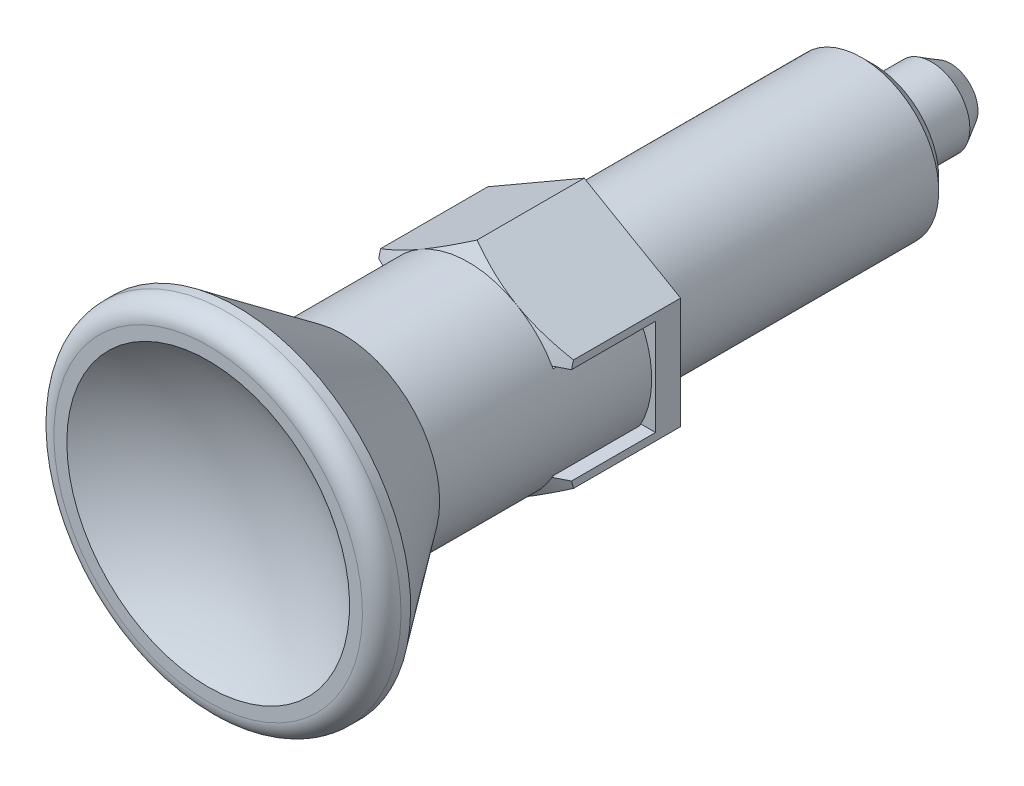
ISO-10303-21;
HEADER;
FILE_DESCRIPTION(('STEP AP214'),'2;1');
FILE_NAME('part.step','',(''),(''),'','','');
FILE_SCHEMA(('AUTOMOTIVE_DESIGN { 1 0 10303 214 1 1 1 1 }'));
ENDSEC;
DATA;
#1=APPLICATION_CONTEXT('core data for automotive mechanical design processes');
#2=APPLICATION_PROTOCOL_DEFINITION('international standard','automotive_design',2000,#1);
#3=PRODUCT_CONTEXT('',#1,'mechanical');
#4=PRODUCT('Part','Part','',(#3));
#5=PRODUCT_RELATED_PRODUCT_CATEGORY('part','',(#4));
#6=PRODUCT_DEFINITION_FORMATION('','',#4);
#7=PRODUCT_DEFINITION_CONTEXT('part definition',#1,'design');
#8=PRODUCT_DEFINITION('design','',#6,#7);
#9=PRODUCT_DEFINITION_SHAPE('','',#8);
#10=(LENGTH_UNIT() NAMED_UNIT(*) SI_UNIT(.MILLI.,.METRE.));
#11=(NAMED_UNIT(*) PLANE_ANGLE_UNIT() SI_UNIT($,.RADIAN.));
#12=(NAMED_UNIT(*) SI_UNIT($,.STERADIAN.) SOLID_ANGLE_UNIT());
#13=UNCERTAINTY_MEASURE_WITH_UNIT(LENGTH_MEASURE(1.E-05),#10,'distance_accuracy_value','');
#14=(GEOMETRIC_REPRESENTATION_CONTEXT(3) GLOBAL_UNCERTAINTY_ASSIGNED_CONTEXT((#13)) GLOBAL_UNIT_ASSIGNED_CONTEXT((#10,
#11,#12)) REPRESENTATION_CONTEXT('',''));
#15=CARTESIAN_POINT('',(0.,0.,0.));
#16=DIRECTION('',(0.,0.,1.));
#17=DIRECTION('',(1.,0.,0.));
#18=AXIS2_PLACEMENT_3D('',#15,#16,#17);
#19=CARTESIAN_POINT('',(5.,-2.8867513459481,0.));
#20=DIRECTION('',(1.,0.,0.));
#21=DIRECTION('',(0.,1.,0.));
#22=AXIS2_PLACEMENT_3D('',#19,#20,#21);
#23=PLANE('',#22);
#24=DIRECTION('',(0.,-1.,0.));
#25=VECTOR('',#24,1.);
#26=CARTESIAN_POINT('',(5.,0.,1.3));
#27=LINE('',#26,#25);
#28=CARTESIAN_POINT('',(5.,2.5,1.3));
#29=VERTEX_POINT('',#28);
#30=CARTESIAN_POINT('',(5.,-2.5,1.3));
#31=VERTEX_POINT('',#30);
#32=EDGE_CURVE('E504',#29,#31,#27,.T.);
#33=ORIENTED_EDGE('',*,*,#32,.T.);
#34=DIRECTION('',(0.,0.,1.));
#35=VECTOR('',#34,1.);
#36=CARTESIAN_POINT('',(5.,-2.5,0.));
#37=LINE('',#36,#35);
#38=CARTESIAN_POINT('',(4.99999999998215,-2.5,5.65926522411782));
#39=VERTEX_POINT('',#38);
#40=EDGE_CURVE('E326',#31,#39,#37,.T.);
#41=ORIENTED_EDGE('',*,*,#40,.T.);
#42=CARTESIAN_POINT('',(5.,0.342551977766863,5.99323319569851));
#43=CARTESIAN_POINT('',(5.,0.228533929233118,5.9977487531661));
#44=CARTESIAN_POINT('',(5.,0.114427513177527,6.00000006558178));
#45=CARTESIAN_POINT('',(5.,-0.113773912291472,5.99999992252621));
#46=CARTESIAN_POINT('',(5.,-0.227868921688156,5.99774892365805));
#47=CARTESIAN_POINT('',(5.,-0.455739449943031,5.98877642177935));
#48=CARTESIAN_POINT('',(5.,-0.569515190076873,5.98206053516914));
#49=CARTESIAN_POINT('',(5.,-0.796724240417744,5.96430420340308));
#50=CARTESIAN_POINT('',(5.,-0.910157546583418,5.95326370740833));
#51=CARTESIAN_POINT('',(5.,-1.24798651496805,5.91414763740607));
#52=CARTESIAN_POINT('',(5.,-1.47169636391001,5.88000125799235));
#53=CARTESIAN_POINT('',(5.,-1.91645265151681,5.79761337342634));
#54=CARTESIAN_POINT('',(5.,-2.13749901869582,5.74937149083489));
#55=CARTESIAN_POINT('',(5.,-2.41633279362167,5.68072626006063));
#56=CARTESIAN_POINT('',(5.,-2.47549023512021,5.66571245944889));
#57=CARTESIAN_POINT('',(5.,-2.59362478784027,5.63487416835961));
#58=CARTESIAN_POINT('',(5.,-2.65260179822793,5.61904929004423));
#59=CARTESIAN_POINT('',(5.,-2.98972314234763,5.52626739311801));
#60=CARTESIAN_POINT('',(5.,-3.26566909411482,5.44123864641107));
#61=CARTESIAN_POINT('',(5.,-3.81343779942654,5.25851552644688));
#62=CARTESIAN_POINT('',(5.,-4.08525768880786,5.16081276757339));
#63=CARTESIAN_POINT('',(5.,-4.62457265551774,4.95629511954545));
#64=CARTESIAN_POINT('',(5.,-4.89207756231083,4.84950599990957));
#65=CARTESIAN_POINT('',(5.,-5.29094166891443,4.68415049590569));
#66=CARTESIAN_POINT('',(5.,-5.4234033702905,4.62821198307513));
#67=CARTESIAN_POINT('',(5.,-5.6876598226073,4.5148074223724));
#68=CARTESIAN_POINT('',(5.,-5.81945462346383,4.45734149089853));
#69=CARTESIAN_POINT('',(5.,-5.95095865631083,4.39921642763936));
#70=B_SPLINE_CURVE_WITH_KNOTS('',3,(#42,#43,#44,#45,#46,#47,#48,#49,#50,#51,#52,#53,#54,#55,#56,
#57,#58,#59,#60,#61,#62,#63,#64,#65,#66,#67,#68,#69),.UNSPECIFIED.,.F.,.F.,(4,2,2,2,2,2,2,2,2,2,
2,2,2,4),(0.,0.342297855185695,0.684560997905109,1.02639441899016,1.36823185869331,
2.0465599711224,2.72490624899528,2.90800276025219,3.0911876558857,3.95694733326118,
4.82328278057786,5.68723829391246,6.11859788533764,6.5499246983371),.UNSPECIFIED.);
#71=CARTESIAN_POINT('',(5.,-2.8867513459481,5.5534180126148));
#72=VERTEX_POINT('',#71);
#73=EDGE_CURVE('E509',#39,#72,#70,.T.);
#74=ORIENTED_EDGE('',*,*,#73,.T.);
#75=DIRECTION('',(0.,0.,1.));
#76=VECTOR('',#75,1.);
#77=CARTESIAN_POINT('',(5.,-2.8867513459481,0.));
#78=LINE('',#77,#76);
#79=CARTESIAN_POINT('',(5.,-2.8867513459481,0.));
#80=VERTEX_POINT('',#79);
#81=EDGE_CURVE('E43',#80,#72,#78,.T.);
#82=ORIENTED_EDGE('',*,*,#81,.F.);
#83=DIRECTION('',(0.,1.,0.));
#84=VECTOR('',#83,1.);
#85=CARTESIAN_POINT('',(5.,-2.8867513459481,0.));
#86=LINE('',#85,#84);
#87=CARTESIAN_POINT('',(5.,2.8867513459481,0.));
#88=VERTEX_POINT('',#87);
#89=EDGE_CURVE('E331',#80,#88,#86,.T.);
#90=ORIENTED_EDGE('',*,*,#89,.T.);
#91=DIRECTION('',(0.,0.,1.));
#92=VECTOR('',#91,1.);
#93=CARTESIAN_POINT('',(5.,2.8867513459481,0.));
#94=LINE('',#93,#92);
#95=CARTESIAN_POINT('',(5.,2.8867513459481,5.5534180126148));
#96=VERTEX_POINT('',#95);
#97=EDGE_CURVE('E341',#88,#96,#94,.T.);
#98=ORIENTED_EDGE('',*,*,#97,.T.);
#99=CARTESIAN_POINT('',(5.,5.95095865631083,4.39921642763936));
#100=CARTESIAN_POINT('',(5.,5.8183000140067,4.4578517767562));
#101=CARTESIAN_POINT('',(5.,5.68534527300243,4.51581653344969));
#102=CARTESIAN_POINT('',(5.,5.41875702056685,4.63018965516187));
#103=CARTESIAN_POINT('',(5.,5.28512346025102,4.68659790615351));
#104=CARTESIAN_POINT('',(5.,4.88284789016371,4.85325833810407));
#105=CARTESIAN_POINT('',(5.,4.61308405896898,4.96083336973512));
#106=CARTESIAN_POINT('',(5.,4.07377810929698,5.16497760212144));
#107=CARTESIAN_POINT('',(5.,3.8042874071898,5.26168157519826));
#108=CARTESIAN_POINT('',(5.,3.26112658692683,5.44263740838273));
#109=CARTESIAN_POINT('',(5.,2.98745701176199,5.52689087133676));
#110=CARTESIAN_POINT('',(5.,2.46464524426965,5.67077851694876));
#111=CARTESIAN_POINT('',(5.,2.21596560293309,5.73207313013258));
#112=CARTESIAN_POINT('',(5.,1.71511227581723,5.83784530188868));
#113=CARTESIAN_POINT('',(5.,1.46294100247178,5.88233392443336));
#114=CARTESIAN_POINT('',(5.,1.08112075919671,5.93416922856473));
#115=CARTESIAN_POINT('',(5.,0.952467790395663,5.94900810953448));
#116=CARTESIAN_POINT('',(5.,0.694642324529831,5.97319923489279));
#117=CARTESIAN_POINT('',(5.,0.56546984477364,5.98255166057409));
#118=CARTESIAN_POINT('',(5.,0.306498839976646,5.99554108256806));
#119=CARTESIAN_POINT('',(5.,0.176699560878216,5.99916309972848));
#120=CARTESIAN_POINT('',(5.,-0.0829550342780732,6.00058321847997));
#121=CARTESIAN_POINT('',(5.,-0.212810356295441,5.99838021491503));
#122=CARTESIAN_POINT('',(5.,-0.342551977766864,5.99323319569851));
#123=B_SPLINE_CURVE_WITH_KNOTS('',3,(#99,#100,#101,#102,#103,#104,#105,#106,#107,#108,#109,#110,
#111,#112,#113,#114,#115,#116,#117,#118,#119,#120,#121,#122),.UNSPECIFIED.,.F.,.F.,(4,2,2,2,2,2,
2,2,2,2,2,4),(0.,0.435114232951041,0.870260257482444,1.7413833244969,2.60011661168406,
3.4587392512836,4.22666928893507,4.99409288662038,5.38251137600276,5.77091702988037,
6.16033629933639,6.54982945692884),.UNSPECIFIED.);
#124=CARTESIAN_POINT('',(4.9999999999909,2.5,5.65926522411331));
#125=VERTEX_POINT('',#124);
#126=EDGE_CURVE('E600',#96,#125,#123,.T.);
#127=ORIENTED_EDGE('',*,*,#126,.T.);
#128=DIRECTION('',(0.,0.,-1.));
#129=VECTOR('',#128,1.);
#130=CARTESIAN_POINT('',(5.,2.5,0.));
#131=LINE('',#130,#129);
#132=EDGE_CURVE('E299',#125,#29,#131,.T.);
#133=ORIENTED_EDGE('',*,*,#132,.T.);
#134=EDGE_LOOP('',(#33,#41,#74,#82,#90,#98,#127,#133));
#135=FACE_BOUND('',#134,.T.);
#136=ADVANCED_FACE('F14',(#135),#23,.T.);
#137=CARTESIAN_POINT('',(0.,0.,4.2679491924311));
#138=DIRECTION('',(0.,0.,-1.));
#139=DIRECTION('',(1.,0.,0.));
#140=AXIS2_PLACEMENT_3D('',#137,#138,#139);
#141=CONICAL_SURFACE('',#140,8.,1.0471975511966);
#142=CARTESIAN_POINT('',(8.49247461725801,2.5,3.77558301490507));
#143=CARTESIAN_POINT('',(8.3218218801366,2.5,3.87009543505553));
#144=CARTESIAN_POINT('',(8.15107581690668,2.5,3.96443967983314));
#145=CARTESIAN_POINT('',(7.80935833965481,2.5,4.15271003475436));
#146=CARTESIAN_POINT('',(7.63838693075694,2.5,4.24663615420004));
#147=CARTESIAN_POINT('',(7.2961990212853,2.5,4.43397815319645));
#148=CARTESIAN_POINT('',(7.12498256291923,2.5,4.52739410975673));
#149=CARTESIAN_POINT('',(6.78221469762,2.5,4.71361899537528));
#150=CARTESIAN_POINT('',(6.61066328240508,2.5,4.80642790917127));
#151=CARTESIAN_POINT('',(6.09630198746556,2.5,5.08327442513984));
#152=CARTESIAN_POINT('',(5.75289971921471,2.5,5.26621813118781));
#153=CARTESIAN_POINT('',(5.23595834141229,2.5,5.53711915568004));
#154=CARTESIAN_POINT('',(5.06334056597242,2.5,5.62683255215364));
#155=CARTESIAN_POINT('',(4.71731364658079,2.5,5.80471468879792));
#156=CARTESIAN_POINT('',(4.5439045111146,2.5,5.89288344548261));
#157=CARTESIAN_POINT('',(4.12604446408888,2.5,6.10230608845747));
#158=CARTESIAN_POINT('',(3.8811014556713,2.5,6.22258795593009));
#159=CARTESIAN_POINT('',(3.51155871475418,2.5,6.39836198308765));
#160=CARTESIAN_POINT('',(3.38805826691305,2.5,6.4561628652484));
#161=CARTESIAN_POINT('',(3.14015572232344,2.5,6.56979386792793));
#162=CARTESIAN_POINT('',(3.01575365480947,2.5,6.62562405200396));
#163=CARTESIAN_POINT('',(2.76552966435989,2.5,6.73489639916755));
#164=CARTESIAN_POINT('',(2.63970497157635,2.5,6.78833225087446));
#165=CARTESIAN_POINT('',(2.38672297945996,2.5,6.89188415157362));
#166=CARTESIAN_POINT('',(2.25956598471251,2.5,6.94200094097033));
#167=CARTESIAN_POINT('',(2.00334679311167,2.5,7.03797984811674));
#168=CARTESIAN_POINT('',(1.87428131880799,2.5,7.08383333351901));
#169=CARTESIAN_POINT('',(1.67919558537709,2.5,7.14827882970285));
#170=CARTESIAN_POINT('',(1.61389348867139,2.5,7.1690454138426));
#171=CARTESIAN_POINT('',(1.48276914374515,2.5,7.20890531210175));
#172=CARTESIAN_POINT('',(1.41694680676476,2.5,7.22799833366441));
#173=CARTESIAN_POINT('',(1.35085554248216,2.5,7.24614061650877));
#174=B_SPLINE_CURVE_WITH_KNOTS('',3,(#142,#143,#144,#145,#146,#147,#148,#149,#150,#151,#152,
#153,#154,#155,#156,#157,#158,#159,#160,#161,#162,#163,#164,#165,#166,#167,#168,#169,#170,#171,
#172,#173),.UNSPECIFIED.,.F.,.F.,(4,2,2,2,2,2,2,2,2,2,2,2,2,2,2,4),(0.,0.58523048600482,
1.17044788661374,1.75557436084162,2.34071549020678,3.50796744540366,4.09157764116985,
4.67518159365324,5.49376149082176,5.90282050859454,6.31186632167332,6.72193358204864,
7.13190905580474,7.54269735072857,7.74825089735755,7.95384030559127),.UNSPECIFIED.);
#175=CARTESIAN_POINT('',(4.3301270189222,2.5,6.));
#176=VERTEX_POINT('',#175);
#177=EDGE_CURVE('E292',#125,#176,#174,.T.);
#178=ORIENTED_EDGE('',*,*,#177,.F.);
#179=ORIENTED_EDGE('',*,*,#126,.F.);
#180=CARTESIAN_POINT('',(-0.000199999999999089,5.77361816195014,5.55335134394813));
#181=CARTESIAN_POINT('',(0.219534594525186,5.64675433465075,5.62661343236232));
#182=CARTESIAN_POINT('',(0.441148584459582,5.51880543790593,5.69324867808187));
#183=CARTESIAN_POINT('',(0.888213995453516,5.26069210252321,5.80956100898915));
#184=CARTESIAN_POINT('',(1.11367335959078,5.13052307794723,5.85919695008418));
#185=CARTESIAN_POINT('',(1.56183230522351,4.87177839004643,5.93644897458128));
#186=CARTESIAN_POINT('',(1.7844620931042,4.74324302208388,5.96457962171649));
#187=CARTESIAN_POINT('',(2.11918990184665,4.54998783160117,5.98980507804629));
#188=CARTESIAN_POINT('',(2.23084219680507,4.48552534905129,5.99538654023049));
#189=CARTESIAN_POINT('',(2.45424997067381,4.35654081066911,6.00079778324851));
#190=CARTESIAN_POINT('',(2.56600544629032,4.2920187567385,6.00062774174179));
#191=CARTESIAN_POINT('',(2.87218423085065,4.11524635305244,5.99224636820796));
#192=CARTESIAN_POINT('',(3.06650608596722,4.00305457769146,5.97817022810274));
#193=CARTESIAN_POINT('',(3.45386010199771,3.77941563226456,5.93353474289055));
#194=CARTESIAN_POINT('',(3.64689090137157,3.66796924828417,5.90296013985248));
#195=CARTESIAN_POINT('',(4.03502534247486,3.44387972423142,5.82653150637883));
#196=CARTESIAN_POINT('',(4.23007999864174,3.33126486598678,5.78035362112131));
#197=CARTESIAN_POINT('',(4.61728034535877,3.10771464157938,5.67554820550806));
#198=CARTESIAN_POINT('',(4.80943099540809,2.99677641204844,5.61694529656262));
#199=CARTESIAN_POINT('',(5.0002,2.88663587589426,5.55335134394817));
#200=B_SPLINE_CURVE_WITH_KNOTS('',3,(#180,#181,#182,#183,#184,#185,#186,#187,#188,#189,#190,
#191,#192,#193,#194,#195,#196,#197,#198,#199),.UNSPECIFIED.,.F.,.F.,(4,2,2,2,2,2,2,2,2,4),(0.,
0.792555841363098,1.58701660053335,2.36181537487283,2.74884076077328,3.13585419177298,
3.80962362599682,4.48401723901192,5.17336882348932,5.86136694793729),.UNSPECIFIED.);
#201=CARTESIAN_POINT('',(2.50000000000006,4.33012701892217,6.));
#202=VERTEX_POINT('',#201);
#203=EDGE_CURVE('E456',#202,#96,#200,.T.);
#204=ORIENTED_EDGE('',*,*,#203,.F.);
#205=CARTESIAN_POINT('',(0.,0.,6.));
#206=DIRECTION('',(0.,0.,1.));
#207=DIRECTION('',(-1.,0.,0.));
#208=AXIS2_PLACEMENT_3D('',#205,#206,#207);
#209=CIRCLE('',#208,5.);
#210=EDGE_CURVE('E421',#176,#202,#209,.T.);
#211=ORIENTED_EDGE('',*,*,#210,.F.);
#212=EDGE_LOOP('',(#178,#179,#204,#211));
#213=FACE_BOUND('',#212,.T.);
#214=ADVANCED_FACE('F497',(#213),#141,.T.);
#215=CARTESIAN_POINT('',(1.45029416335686,-2.5,7.2180838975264));
#216=CARTESIAN_POINT('',(1.51231780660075,-2.5,7.20011257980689));
#217=CARTESIAN_POINT('',(1.57410694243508,-2.5,7.18135180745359));
#218=CARTESIAN_POINT('',(1.69723500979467,-2.5,7.14243214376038));
#219=CARTESIAN_POINT('',(1.75857399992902,-2.5,7.12227343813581));
#220=CARTESIAN_POINT('',(1.94189428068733,-2.5,7.05998926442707));
#221=CARTESIAN_POINT('',(2.06325413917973,-2.5,7.01603348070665));
#222=CARTESIAN_POINT('',(2.30433891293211,-2.5,6.92446042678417));
#223=CARTESIAN_POINT('',(2.42406619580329,-2.5,6.87684931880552));
#224=CARTESIAN_POINT('',(2.66235104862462,-2.5,6.77873964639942));
#225=CARTESIAN_POINT('',(2.7809084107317,-2.5,6.72824057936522));
#226=CARTESIAN_POINT('',(3.01678185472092,-2.5,6.62511081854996));
#227=CARTESIAN_POINT('',(3.13410007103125,-2.5,6.57248498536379));
#228=CARTESIAN_POINT('',(3.36792863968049,-2.5,6.46546503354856));
#229=CARTESIAN_POINT('',(3.48443896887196,-2.5,6.41107086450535));
#230=CARTESIAN_POINT('',(3.83308475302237,-2.5,6.24573899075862));
#231=CARTESIAN_POINT('',(4.06422363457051,-2.5,6.13270148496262));
#232=CARTESIAN_POINT('',(4.47202120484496,-2.5,5.92921314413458));
#233=CARTESIAN_POINT('',(4.64905461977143,-2.5,5.83950644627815));
#234=CARTESIAN_POINT('',(5.00227125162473,-2.5,5.65843276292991));
#235=CARTESIAN_POINT('',(5.17845446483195,-2.5,5.56706577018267));
#236=CARTESIAN_POINT('',(5.7059502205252,-2.5,5.29112625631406));
#237=CARTESIAN_POINT('',(6.05628050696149,-2.5,5.1046790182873));
#238=CARTESIAN_POINT('',(6.7562129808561,-2.5,4.72821097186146));
#239=CARTESIAN_POINT('',(7.10581073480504,-2.5,4.53818195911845));
#240=CARTESIAN_POINT('',(7.62937512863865,-2.5,4.25158434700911));
#241=CARTESIAN_POINT('',(7.8037654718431,-2.5,4.1557885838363));
#242=CARTESIAN_POINT('',(8.15230652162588,-2.5,3.96376442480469));
#243=CARTESIAN_POINT('',(8.32645722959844,-2.5,3.86753603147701));
#244=CARTESIAN_POINT('',(8.50051058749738,-2.5,3.77113211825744));
#245=B_SPLINE_CURVE_WITH_KNOTS('',3,(#215,#216,#217,#218,#219,#220,#221,#222,#223,#224,#225,
#226,#227,#228,#229,#230,#231,#232,#233,#234,#235,#236,#237,#238,#239,#240,#241,#242,#243,#244),
.UNSPECIFIED.,.F.,.F.,(4,2,2,2,2,2,2,2,2,2,2,2,2,2,4),(0.,0.193710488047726,0.387395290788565,
0.774529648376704,1.16102512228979,1.54758806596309,1.93331263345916,2.31904820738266,
3.09088494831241,3.68627077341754,4.28165920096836,5.4721953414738,6.66590655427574,
7.26281420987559,7.8597183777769),.UNSPECIFIED.);
#246=CARTESIAN_POINT('',(4.3301270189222,-2.5,6.));
#247=VERTEX_POINT('',#246);
#248=EDGE_CURVE('E320',#247,#39,#245,.T.);
#249=ORIENTED_EDGE('',*,*,#248,.F.);
#250=CARTESIAN_POINT('',(2.50000000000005,-4.33012701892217,6.));
#251=VERTEX_POINT('',#250);
#252=EDGE_CURVE('E552',#251,#247,#209,.T.);
#253=ORIENTED_EDGE('',*,*,#252,.F.);
#254=CARTESIAN_POINT('',(5.0002,-2.88663587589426,5.55335134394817));
#255=CARTESIAN_POINT('',(4.78046540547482,-3.01349970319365,5.62661343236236));
#256=CARTESIAN_POINT('',(4.55885141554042,-3.14144859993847,5.6932486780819));
#257=CARTESIAN_POINT('',(4.11178600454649,-3.39956193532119,5.80956100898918));
#258=CARTESIAN_POINT('',(3.88632664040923,-3.52973095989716,5.8591969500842));
#259=CARTESIAN_POINT('',(3.4381676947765,-3.78847564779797,5.93644897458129));
#260=CARTESIAN_POINT('',(3.21553790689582,-3.91701101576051,5.9645796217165));
#261=CARTESIAN_POINT('',(2.88081009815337,-4.11026620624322,5.9898050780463));
#262=CARTESIAN_POINT('',(2.76915780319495,-4.1747286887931,5.9953865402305));
#263=CARTESIAN_POINT('',(2.54575002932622,-4.30371322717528,6.00079778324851));
#264=CARTESIAN_POINT('',(2.4339945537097,-4.36823528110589,6.00062774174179));
#265=CARTESIAN_POINT('',(2.12781576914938,-4.54500768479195,5.99224636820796));
#266=CARTESIAN_POINT('',(1.9334939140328,-4.65719946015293,5.97817022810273));
#267=CARTESIAN_POINT('',(1.54613989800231,-4.88083840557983,5.93353474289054));
#268=CARTESIAN_POINT('',(1.35310909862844,-4.99228478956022,5.90296013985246));
#269=CARTESIAN_POINT('',(0.964974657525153,-5.21637431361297,5.8265315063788));
#270=CARTESIAN_POINT('',(0.76992000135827,-5.32898917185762,5.78035362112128));
#271=CARTESIAN_POINT('',(0.382719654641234,-5.55253939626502,5.67554820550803));
#272=CARTESIAN_POINT('',(0.190569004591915,-5.66347762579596,5.61694529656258));
#273=CARTESIAN_POINT('',(-0.000199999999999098,-5.77361816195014,5.55335134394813));
#274=B_SPLINE_CURVE_WITH_KNOTS('',3,(#254,#255,#256,#257,#258,#259,#260,#261,#262,#263,#264,
#265,#266,#267,#268,#269,#270,#271,#272,#273),.UNSPECIFIED.,.F.,.F.,(4,2,2,2,2,2,2,2,2,4),(0.,
0.792555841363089,1.58701660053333,2.36181537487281,2.74884076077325,3.13585419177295,
3.8096236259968,4.48401723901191,5.17336882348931,5.86136694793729),.UNSPECIFIED.);
#275=EDGE_CURVE('E398',#72,#251,#274,.T.);
#276=ORIENTED_EDGE('',*,*,#275,.F.);
#277=ORIENTED_EDGE('',*,*,#73,.F.);
#278=EDGE_LOOP('',(#249,#253,#276,#277));
#279=FACE_BOUND('',#278,.T.);
#280=ADVANCED_FACE('F492',(#279),#141,.T.);
#281=CARTESIAN_POINT('',(0.,0.,-19.));
#282=DIRECTION('',(0.,0.,1.));
#283=DIRECTION('',(0.,-1.,0.));
#284=AXIS2_PLACEMENT_3D('',#281,#282,#283);
#285=CYLINDRICAL_SURFACE('',#284,5.);
#286=CARTESIAN_POINT('',(0.,0.,1.5));
#287=DIRECTION('',(0.,0.,1.));
#288=DIRECTION('',(0.,-1.,0.));
#289=AXIS2_PLACEMENT_3D('',#286,#287,#288);
#290=CIRCLE('',#289,5.);
#291=CARTESIAN_POINT('',(-4.3863424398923,-2.4,1.5));
#292=VERTEX_POINT('',#291);
#293=CARTESIAN_POINT('',(-4.3863424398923,2.4,1.5));
#294=VERTEX_POINT('',#293);
#295=EDGE_CURVE('E242',#292,#294,#290,.F.);
#296=ORIENTED_EDGE('',*,*,#295,.F.);
#297=DIRECTION('',(0.,0.,1.));
#298=VECTOR('',#297,1.);
#299=CARTESIAN_POINT('',(-4.3863424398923,-2.4,1.3));
#300=LINE('',#299,#298);
#301=CARTESIAN_POINT('',(-4.38634243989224,-2.4,6.));
#302=VERTEX_POINT('',#301);
#303=EDGE_CURVE('E408',#292,#302,#300,.T.);
#304=ORIENTED_EDGE('',*,*,#303,.T.);
#305=CARTESIAN_POINT('',(-4.33012701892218,-2.5,6.));
#306=VERTEX_POINT('',#305);
#307=EDGE_CURVE('E423',#302,#306,#209,.T.);
#308=ORIENTED_EDGE('',*,*,#307,.T.);
#309=CARTESIAN_POINT('',(-2.50000000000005,-4.33012701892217,6.));
#310=VERTEX_POINT('',#309);
#311=EDGE_CURVE('E422',#306,#310,#209,.T.);
#312=ORIENTED_EDGE('',*,*,#311,.T.);
#313=EDGE_CURVE('E553',#310,#251,#209,.T.);
#314=ORIENTED_EDGE('',*,*,#313,.T.);
#315=ORIENTED_EDGE('',*,*,#252,.T.);
#316=CARTESIAN_POINT('',(4.38634243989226,-2.4,6.));
#317=VERTEX_POINT('',#316);
#318=EDGE_CURVE('E416',#247,#317,#209,.T.);
#319=ORIENTED_EDGE('',*,*,#318,.T.);
#320=DIRECTION('',(0.,0.,1.));
#321=VECTOR('',#320,1.);
#322=CARTESIAN_POINT('',(4.3863424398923,-2.4,1.3));
#323=LINE('',#322,#321);
#324=CARTESIAN_POINT('',(4.3863424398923,-2.4,1.5));
#325=VERTEX_POINT('',#324);
#326=EDGE_CURVE('E411',#325,#317,#323,.T.);
#327=ORIENTED_EDGE('',*,*,#326,.F.);
#328=CARTESIAN_POINT('',(0.,0.,1.5));
#329=DIRECTION('',(0.,0.,-1.));
#330=DIRECTION('',(0.,1.,0.));
#331=AXIS2_PLACEMENT_3D('',#328,#329,#330);
#332=CIRCLE('',#331,5.);
#333=CARTESIAN_POINT('',(4.38634243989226,2.4,1.5));
#334=VERTEX_POINT('',#333);
#335=EDGE_CURVE('E536',#325,#334,#332,.F.);
#336=ORIENTED_EDGE('',*,*,#335,.T.);
#337=DIRECTION('',(0.,0.,1.));
#338=VECTOR('',#337,1.);
#339=CARTESIAN_POINT('',(4.3863424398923,2.4,1.3));
#340=LINE('',#339,#338);
#341=CARTESIAN_POINT('',(4.38634243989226,2.4,6.));
#342=VERTEX_POINT('',#341);
#343=EDGE_CURVE('E413',#334,#342,#340,.T.);
#344=ORIENTED_EDGE('',*,*,#343,.T.);
#345=EDGE_CURVE('E417',#342,#176,#209,.T.);
#346=ORIENTED_EDGE('',*,*,#345,.T.);
#347=ORIENTED_EDGE('',*,*,#210,.T.);
#348=CARTESIAN_POINT('',(-2.50000000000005,4.33012701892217,6.));
#349=VERTEX_POINT('',#348);
#350=EDGE_CURVE('E529',#202,#349,#209,.T.);
#351=ORIENTED_EDGE('',*,*,#350,.T.);
#352=CARTESIAN_POINT('',(-4.33012701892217,2.5,6.));
#353=VERTEX_POINT('',#352);
#354=EDGE_CURVE('E554',#349,#353,#209,.T.);
#355=ORIENTED_EDGE('',*,*,#354,.T.);
#356=CARTESIAN_POINT('',(-4.3863424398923,2.4,6.));
#357=VERTEX_POINT('',#356);
#358=EDGE_CURVE('E530',#353,#357,#209,.T.);
#359=ORIENTED_EDGE('',*,*,#358,.T.);
#360=DIRECTION('',(0.,0.,1.));
#361=VECTOR('',#360,1.);
#362=CARTESIAN_POINT('',(-4.3863424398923,2.4,1.3));
#363=LINE('',#362,#361);
#364=EDGE_CURVE('E405',#294,#357,#363,.T.);
#365=ORIENTED_EDGE('',*,*,#364,.F.);
#366=EDGE_LOOP('',(#296,#304,#308,#312,#314,#315,#319,#327,#336,#344,#346,#347,#351,#355,#359,#365));
#367=FACE_BOUND('',#366,.T.);
#368=CARTESIAN_POINT('',(0.,0.,12.4944723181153));
#369=DIRECTION('',(0.,0.,1.));
#370=DIRECTION('',(0.,-1.,0.));
#371=AXIS2_PLACEMENT_3D('',#368,#369,#370);
#372=CIRCLE('',#371,5.);
#373=CARTESIAN_POINT('',(0.,-5.,12.4944723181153));
#374=VERTEX_POINT('',#373);
#375=EDGE_CURVE('E441',#374,#374,#372,.T.);
#376=ORIENTED_EDGE('',*,*,#375,.F.);
#377=EDGE_LOOP('',(#376));
#378=FACE_BOUND('',#377,.T.);
#379=ADVANCED_FACE('F532',(#367,#378),#285,.T.);
#380=CARTESIAN_POINT('',(4.,0.,0.));
#381=DIRECTION('',(0.,0.,1.));
#382=DIRECTION('',(-1.,0.,0.));
#383=AXIS2_PLACEMENT_3D('',#380,#381,#382);
#384=PLANE('',#383);
#385=CARTESIAN_POINT('',(0.,0.,0.));
#386=DIRECTION('',(0.,0.,1.));
#387=DIRECTION('',(-1.,0.,0.));
#388=AXIS2_PLACEMENT_3D('',#385,#386,#387);
#389=CIRCLE('',#388,4.);
#390=CARTESIAN_POINT('',(-3.99999999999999,0.,0.));
#391=VERTEX_POINT('',#390);
#392=EDGE_CURVE('E420',#391,#391,#389,.T.);
#393=ORIENTED_EDGE('',*,*,#392,.T.);
#394=EDGE_LOOP('',(#393));
#395=FACE_BOUND('',#394,.T.);
#396=DIRECTION('',(-0.866025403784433,0.500000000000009,0.));
#397=VECTOR('',#396,1.);
#398=CARTESIAN_POINT('',(5.,2.8867513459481,0.));
#399=LINE('',#398,#397);
#400=CARTESIAN_POINT('',(0.,5.7735026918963,0.));
#401=VERTEX_POINT('',#400);
#402=EDGE_CURVE('E329',#88,#401,#399,.T.);
#403=ORIENTED_EDGE('',*,*,#402,.F.);
#404=ORIENTED_EDGE('',*,*,#89,.F.);
#405=DIRECTION('',(0.866025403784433,0.500000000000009,0.));
#406=VECTOR('',#405,1.);
#407=CARTESIAN_POINT('',(0.,-5.7735026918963,0.));
#408=LINE('',#407,#406);
#409=CARTESIAN_POINT('',(0.,-5.7735026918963,0.));
#410=VERTEX_POINT('',#409);
#411=EDGE_CURVE('E333',#410,#80,#408,.T.);
#412=ORIENTED_EDGE('',*,*,#411,.F.);
#413=DIRECTION('',(0.866025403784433,-0.500000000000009,0.));
#414=VECTOR('',#413,1.);
#415=CARTESIAN_POINT('',(-5.,-2.8867513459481,0.));
#416=LINE('',#415,#414);
#417=CARTESIAN_POINT('',(-5.,-2.8867513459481,0.));
#418=VERTEX_POINT('',#417);
#419=EDGE_CURVE('E335',#418,#410,#416,.T.);
#420=ORIENTED_EDGE('',*,*,#419,.F.);
#421=DIRECTION('',(0.,-1.,0.));
#422=VECTOR('',#421,1.);
#423=CARTESIAN_POINT('',(-5.,2.8867513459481,0.));
#424=LINE('',#423,#422);
#425=CARTESIAN_POINT('',(-5.,2.8867513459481,0.));
#426=VERTEX_POINT('',#425);
#427=EDGE_CURVE('E337',#426,#418,#424,.T.);
#428=ORIENTED_EDGE('',*,*,#427,.F.);
#429=DIRECTION('',(-0.866025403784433,-0.500000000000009,0.));
#430=VECTOR('',#429,1.);
#431=CARTESIAN_POINT('',(0.,5.7735026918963,0.));
#432=LINE('',#431,#430);
#433=EDGE_CURVE('E339',#401,#426,#432,.T.);
#434=ORIENTED_EDGE('',*,*,#433,.F.);
#435=EDGE_LOOP('',(#403,#404,#412,#420,#428,#434));
#436=FACE_BOUND('',#435,.T.);
#437=ADVANCED_FACE('F385',(#395,#436),#384,.F.);
#438=CARTESIAN_POINT('',(-5.,-2.8867513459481,0.));
#439=DIRECTION('',(-0.500000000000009,-0.866025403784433,0.));
#440=DIRECTION('',(0.866025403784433,-0.500000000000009,0.));
#441=AXIS2_PLACEMENT_3D('',#438,#439,#440);
#442=PLANE('',#441);
#443=CARTESIAN_POINT('',(0.000200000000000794,-5.77361816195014,5.55335134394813));
#444=CARTESIAN_POINT('',(-0.219534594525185,-5.64675433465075,5.62661343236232));
#445=CARTESIAN_POINT('',(-0.441148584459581,-5.51880543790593,5.69324867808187));
#446=CARTESIAN_POINT('',(-0.888213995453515,-5.26069210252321,5.80956100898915));
#447=CARTESIAN_POINT('',(-1.11367335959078,-5.13052307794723,5.85919695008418));
#448=CARTESIAN_POINT('',(-1.56183230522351,-4.87177839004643,5.93644897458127));
#449=CARTESIAN_POINT('',(-1.7844620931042,-4.74324302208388,5.96457962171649));
#450=CARTESIAN_POINT('',(-2.11918990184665,-4.54998783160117,5.98980507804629));
#451=CARTESIAN_POINT('',(-2.23084219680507,-4.48552534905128,5.99538654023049));
#452=CARTESIAN_POINT('',(-2.45424997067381,-4.35654081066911,6.00079778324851));
#453=CARTESIAN_POINT('',(-2.56600544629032,-4.2920187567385,6.00062774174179));
#454=CARTESIAN_POINT('',(-2.87218423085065,-4.11524635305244,5.99224636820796));
#455=CARTESIAN_POINT('',(-3.06650608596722,-4.00305457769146,5.97817022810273));
#456=CARTESIAN_POINT('',(-3.45386010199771,-3.77941563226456,5.93353474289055));
#457=CARTESIAN_POINT('',(-3.64689090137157,-3.66796924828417,5.90296013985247));
#458=CARTESIAN_POINT('',(-4.03502534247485,-3.44387972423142,5.82653150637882));
#459=CARTESIAN_POINT('',(-4.23007999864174,-3.33126486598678,5.7803536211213));
#460=CARTESIAN_POINT('',(-4.61728034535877,-3.10771464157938,5.67554820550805));
#461=CARTESIAN_POINT('',(-4.80943099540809,-2.99677641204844,5.61694529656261));
#462=CARTESIAN_POINT('',(-5.0002,-2.88663587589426,5.55335134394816));
#463=B_SPLINE_CURVE_WITH_KNOTS('',3,(#443,#444,#445,#446,#447,#448,#449,#450,#451,#452,#453,
#454,#455,#456,#457,#458,#459,#460,#461,#462),.UNSPECIFIED.,.F.,.F.,(4,2,2,2,2,2,2,2,2,4),(0.,
0.792555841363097,1.58701660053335,2.36181537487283,2.74884076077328,3.13585419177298,
3.80962362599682,4.48401723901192,5.17336882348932,5.86136694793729),.UNSPECIFIED.);
#464=CARTESIAN_POINT('',(0.,-5.7735026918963,5.55341801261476));
#465=VERTEX_POINT('',#464);
#466=EDGE_CURVE('E397',#465,#310,#463,.T.);
#467=ORIENTED_EDGE('',*,*,#466,.T.);
#468=CARTESIAN_POINT('',(-5.,-2.8867513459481,5.55341801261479));
#469=VERTEX_POINT('',#468);
#470=EDGE_CURVE('E390',#310,#469,#463,.T.);
#471=ORIENTED_EDGE('',*,*,#470,.T.);
#472=DIRECTION('',(0.,0.,1.));
#473=VECTOR('',#472,1.);
#474=CARTESIAN_POINT('',(-5.,-2.8867513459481,0.));
#475=LINE('',#474,#473);
#476=EDGE_CURVE('E346',#418,#469,#475,.T.);
#477=ORIENTED_EDGE('',*,*,#476,.F.);
#478=ORIENTED_EDGE('',*,*,#419,.T.);
#479=DIRECTION('',(0.,0.,1.));
#480=VECTOR('',#479,1.);
#481=CARTESIAN_POINT('',(0.,-5.7735026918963,0.));
#482=LINE('',#481,#480);
#483=EDGE_CURVE('E349',#410,#465,#482,.T.);
#484=ORIENTED_EDGE('',*,*,#483,.T.);
#485=EDGE_LOOP('',(#467,#471,#477,#478,#484));
#486=FACE_BOUND('',#485,.T.);
#487=ADVANCED_FACE('F379',(#486),#442,.T.);
#488=CARTESIAN_POINT('',(0.,-5.7735026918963,0.));
#489=DIRECTION('',(0.500000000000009,-0.866025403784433,0.));
#490=DIRECTION('',(0.866025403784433,0.500000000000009,0.));
#491=AXIS2_PLACEMENT_3D('',#488,#489,#490);
#492=PLANE('',#491);
#493=ORIENTED_EDGE('',*,*,#275,.T.);
#494=EDGE_CURVE('E399',#251,#465,#274,.T.);
#495=ORIENTED_EDGE('',*,*,#494,.T.);
#496=ORIENTED_EDGE('',*,*,#483,.F.);
#497=ORIENTED_EDGE('',*,*,#411,.T.);
#498=ORIENTED_EDGE('',*,*,#81,.T.);
#499=EDGE_LOOP('',(#493,#495,#496,#497,#498));
#500=FACE_BOUND('',#499,.T.);
#501=ADVANCED_FACE('F384',(#500),#492,.T.);
#502=CARTESIAN_POINT('',(5.,2.8867513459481,0.));
#503=DIRECTION('',(0.500000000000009,0.866025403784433,0.));
#504=DIRECTION('',(-0.866025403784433,0.500000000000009,0.));
#505=AXIS2_PLACEMENT_3D('',#502,#503,#504);
#506=PLANE('',#505);
#507=CARTESIAN_POINT('',(0.,5.7735026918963,5.55341801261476));
#508=VERTEX_POINT('',#507);
#509=EDGE_CURVE('E463',#508,#202,#200,.T.);
#510=ORIENTED_EDGE('',*,*,#509,.T.);
#511=ORIENTED_EDGE('',*,*,#203,.T.);
#512=ORIENTED_EDGE('',*,*,#97,.F.);
#513=ORIENTED_EDGE('',*,*,#402,.T.);
#514=DIRECTION('',(0.,0.,1.));
#515=VECTOR('',#514,1.);
#516=CARTESIAN_POINT('',(0.,5.7735026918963,0.));
#517=LINE('',#516,#515);
#518=EDGE_CURVE('E345',#401,#508,#517,.T.);
#519=ORIENTED_EDGE('',*,*,#518,.T.);
#520=EDGE_LOOP('',(#510,#511,#512,#513,#519));
#521=FACE_BOUND('',#520,.T.);
#522=ADVANCED_FACE('F470',(#521),#506,.T.);
#523=CARTESIAN_POINT('',(0.,5.7735026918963,0.));
#524=DIRECTION('',(-0.500000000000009,0.866025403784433,0.));
#525=DIRECTION('',(-0.866025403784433,-0.500000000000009,0.));
#526=AXIS2_PLACEMENT_3D('',#523,#524,#525);
#527=PLANE('',#526);
#528=CARTESIAN_POINT('',(-5.0002,2.88663587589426,5.55335134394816));
#529=CARTESIAN_POINT('',(-4.78046540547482,3.01349970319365,5.62661343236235));
#530=CARTESIAN_POINT('',(-4.55885141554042,3.14144859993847,5.69324867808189));
#531=CARTESIAN_POINT('',(-4.11178600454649,3.39956193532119,5.80956100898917));
#532=CARTESIAN_POINT('',(-3.88632664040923,3.52973095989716,5.85919695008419));
#533=CARTESIAN_POINT('',(-3.43816769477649,3.78847564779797,5.93644897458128));
#534=CARTESIAN_POINT('',(-3.21553790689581,3.91701101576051,5.96457962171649));
#535=CARTESIAN_POINT('',(-2.88081009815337,4.11026620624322,5.98980507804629));
#536=CARTESIAN_POINT('',(-2.76915780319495,4.17472868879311,5.99538654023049));
#537=CARTESIAN_POINT('',(-2.54575002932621,4.30371322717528,6.00079778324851));
#538=CARTESIAN_POINT('',(-2.4339945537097,4.36823528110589,6.00062774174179));
#539=CARTESIAN_POINT('',(-2.12781576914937,4.54500768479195,5.99224636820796));
#540=CARTESIAN_POINT('',(-1.9334939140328,4.65719946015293,5.97817022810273));
#541=CARTESIAN_POINT('',(-1.5461398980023,4.88083840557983,5.93353474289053));
#542=CARTESIAN_POINT('',(-1.35310909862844,4.99228478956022,5.90296013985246));
#543=CARTESIAN_POINT('',(-0.96497465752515,5.21637431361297,5.8265315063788));
#544=CARTESIAN_POINT('',(-0.769920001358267,5.32898917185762,5.78035362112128));
#545=CARTESIAN_POINT('',(-0.382719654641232,5.55253939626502,5.67554820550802));
#546=CARTESIAN_POINT('',(-0.190569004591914,5.66347762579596,5.61694529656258));
#547=CARTESIAN_POINT('',(0.000200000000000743,5.77361816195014,5.55335134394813));
#548=B_SPLINE_CURVE_WITH_KNOTS('',3,(#528,#529,#530,#531,#532,#533,#534,#535,#536,#537,#538,
#539,#540,#541,#542,#543,#544,#545,#546,#547),.UNSPECIFIED.,.F.,.F.,(4,2,2,2,2,2,2,2,2,4),(0.,
0.792555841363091,1.58701660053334,2.36181537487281,2.74884076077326,3.13585419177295,
3.8096236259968,4.48401723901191,5.17336882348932,5.86136694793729),.UNSPECIFIED.);
#549=CARTESIAN_POINT('',(-5.,2.8867513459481,5.55341801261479));
#550=VERTEX_POINT('',#549);
#551=EDGE_CURVE('E627',#550,#349,#548,.T.);
#552=ORIENTED_EDGE('',*,*,#551,.T.);
#553=EDGE_CURVE('E464',#349,#508,#548,.T.);
#554=ORIENTED_EDGE('',*,*,#553,.T.);
#555=ORIENTED_EDGE('',*,*,#518,.F.);
#556=ORIENTED_EDGE('',*,*,#433,.T.);
#557=DIRECTION('',(0.,0.,1.));
#558=VECTOR('',#557,1.);
#559=CARTESIAN_POINT('',(-5.,2.8867513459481,0.));
#560=LINE('',#559,#558);
#561=EDGE_CURVE('E342',#426,#550,#560,.T.);
#562=ORIENTED_EDGE('',*,*,#561,.T.);
#563=EDGE_LOOP('',(#552,#554,#555,#556,#562));
#564=FACE_BOUND('',#563,.T.);
#565=ADVANCED_FACE('F376',(#564),#527,.T.);
#566=CARTESIAN_POINT('',(-5.,2.8867513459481,0.));
#567=DIRECTION('',(-1.,0.,0.));
#568=DIRECTION('',(0.,-1.,0.));
#569=AXIS2_PLACEMENT_3D('',#566,#567,#568);
#570=PLANE('',#569);
#571=DIRECTION('',(0.,0.,1.));
#572=VECTOR('',#571,1.);
#573=CARTESIAN_POINT('',(-5.,-2.5,0.));
#574=LINE('',#573,#572);
#575=CARTESIAN_POINT('',(-5.,-2.5,1.3));
#576=VERTEX_POINT('',#575);
#577=CARTESIAN_POINT('',(-5.,-2.5,5.6592652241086));
#578=VERTEX_POINT('',#577);
#579=EDGE_CURVE('E244',#576,#578,#574,.T.);
#580=ORIENTED_EDGE('',*,*,#579,.F.);
#581=DIRECTION('',(0.,1.,0.));
#582=VECTOR('',#581,1.);
#583=CARTESIAN_POINT('',(-5.,0.,1.3));
#584=LINE('',#583,#582);
#585=CARTESIAN_POINT('',(-5.,2.5,1.3));
#586=VERTEX_POINT('',#585);
#587=EDGE_CURVE('E355',#576,#586,#584,.T.);
#588=ORIENTED_EDGE('',*,*,#587,.T.);
#589=DIRECTION('',(0.,0.,-1.));
#590=VECTOR('',#589,1.);
#591=CARTESIAN_POINT('',(-5.,2.5,0.));
#592=LINE('',#591,#590);
#593=CARTESIAN_POINT('',(-5.00000000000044,2.5,5.65926522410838));
#594=VERTEX_POINT('',#593);
#595=EDGE_CURVE('E201',#594,#586,#592,.T.);
#596=ORIENTED_EDGE('',*,*,#595,.F.);
#597=CARTESIAN_POINT('',(-5.,-0.342551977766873,5.9932331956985));
#598=CARTESIAN_POINT('',(-5.,-0.228533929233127,5.99774875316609));
#599=CARTESIAN_POINT('',(-5.,-0.114427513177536,6.00000006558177));
#600=CARTESIAN_POINT('',(-5.,0.113773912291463,5.99999992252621));
#601=CARTESIAN_POINT('',(-5.,0.227868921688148,5.99774892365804));
#602=CARTESIAN_POINT('',(-5.,0.455739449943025,5.98877642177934));
#603=CARTESIAN_POINT('',(-5.,0.569515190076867,5.98206053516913));
#604=CARTESIAN_POINT('',(-5.,0.79672424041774,5.96430420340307));
#605=CARTESIAN_POINT('',(-5.,0.910157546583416,5.95326370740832));
#606=CARTESIAN_POINT('',(-5.,1.24798651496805,5.91414763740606));
#607=CARTESIAN_POINT('',(-5.,1.47169636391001,5.88000125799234));
#608=CARTESIAN_POINT('',(-5.,1.91645265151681,5.79761337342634));
#609=CARTESIAN_POINT('',(-5.,2.13749901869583,5.74937149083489));
#610=CARTESIAN_POINT('',(-5.,2.41633279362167,5.68072626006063));
#611=CARTESIAN_POINT('',(-5.,2.47549023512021,5.66571245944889));
#612=CARTESIAN_POINT('',(-5.,2.59362478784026,5.6348741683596));
#613=CARTESIAN_POINT('',(-5.,2.65260179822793,5.61904929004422));
#614=CARTESIAN_POINT('',(-5.,2.98972314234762,5.52626739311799));
#615=CARTESIAN_POINT('',(-5.,3.26566909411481,5.44123864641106));
#616=CARTESIAN_POINT('',(-5.,3.81343779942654,5.25851552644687));
#617=CARTESIAN_POINT('',(-5.,4.08525768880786,5.16081276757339));
#618=CARTESIAN_POINT('',(-5.,4.62457265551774,4.95629511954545));
#619=CARTESIAN_POINT('',(-5.,4.89207756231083,4.84950599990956));
#620=CARTESIAN_POINT('',(-5.,5.29094166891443,4.68415049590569));
#621=CARTESIAN_POINT('',(-5.,5.42340337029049,4.62821198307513));
#622=CARTESIAN_POINT('',(-5.,5.6876598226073,4.5148074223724));
#623=CARTESIAN_POINT('',(-5.,5.81945462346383,4.45734149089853));
#624=CARTESIAN_POINT('',(-5.,5.95095865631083,4.39921642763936));
#625=B_SPLINE_CURVE_WITH_KNOTS('',3,(#597,#598,#599,#600,#601,#602,#603,#604,#605,#606,#607,
#608,#609,#610,#611,#612,#613,#614,#615,#616,#617,#618,#619,#620,#621,#622,#623,#624),
.UNSPECIFIED.,.F.,.F.,(4,2,2,2,2,2,2,2,2,2,2,2,2,4),(0.,0.342297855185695,0.68456099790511,
1.02639441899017,1.36823185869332,2.04655997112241,2.72490624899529,2.9080027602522,
3.09118765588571,3.95694733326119,4.82328278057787,5.68723829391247,6.11859788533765,
6.54992469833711),.UNSPECIFIED.);
#626=EDGE_CURVE('E359',#594,#550,#625,.T.);
#627=ORIENTED_EDGE('',*,*,#626,.T.);
#628=ORIENTED_EDGE('',*,*,#561,.F.);
#629=ORIENTED_EDGE('',*,*,#427,.T.);
#630=ORIENTED_EDGE('',*,*,#476,.T.);
#631=CARTESIAN_POINT('',(-5.,-5.95095865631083,4.39921642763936));
#632=CARTESIAN_POINT('',(-5.,-5.8183000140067,4.45785177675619));
#633=CARTESIAN_POINT('',(-5.,-5.68534527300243,4.51581653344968));
#634=CARTESIAN_POINT('',(-5.,-5.41875702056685,4.63018965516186));
#635=CARTESIAN_POINT('',(-5.,-5.28512346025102,4.6865979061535));
#636=CARTESIAN_POINT('',(-5.,-4.88284789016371,4.85325833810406));
#637=CARTESIAN_POINT('',(-5.,-4.61308405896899,4.96083336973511));
#638=CARTESIAN_POINT('',(-5.,-4.07377810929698,5.16497760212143));
#639=CARTESIAN_POINT('',(-5.,-3.8042874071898,5.26168157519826));
#640=CARTESIAN_POINT('',(-5.,-3.26112658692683,5.44263740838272));
#641=CARTESIAN_POINT('',(-5.,-2.98745701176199,5.52689087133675));
#642=CARTESIAN_POINT('',(-5.,-2.46464524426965,5.67077851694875));
#643=CARTESIAN_POINT('',(-5.,-2.21596560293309,5.73207313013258));
#644=CARTESIAN_POINT('',(-5.,-1.71511227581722,5.83784530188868));
#645=CARTESIAN_POINT('',(-5.,-1.46294100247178,5.88233392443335));
#646=CARTESIAN_POINT('',(-5.,-1.08112075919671,5.93416922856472));
#647=CARTESIAN_POINT('',(-5.,-0.952467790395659,5.94900810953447));
#648=CARTESIAN_POINT('',(-5.,-0.694642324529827,5.97319923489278));
#649=CARTESIAN_POINT('',(-5.,-0.565469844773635,5.98255166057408));
#650=CARTESIAN_POINT('',(-5.,-0.306498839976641,5.99554108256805));
#651=CARTESIAN_POINT('',(-5.,-0.17669956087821,5.99916309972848));
#652=CARTESIAN_POINT('',(-5.,0.0829550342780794,6.00058321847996));
#653=CARTESIAN_POINT('',(-5.,0.212810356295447,5.99838021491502));
#654=CARTESIAN_POINT('',(-5.,0.342551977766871,5.9932331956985));
#655=B_SPLINE_CURVE_WITH_KNOTS('',3,(#631,#632,#633,#634,#635,#636,#637,#638,#639,#640,#641,
#642,#643,#644,#645,#646,#647,#648,#649,#650,#651,#652,#653,#654),.UNSPECIFIED.,.F.,.F.,(4,2,2,
2,2,2,2,2,2,2,2,4),(0.,0.435114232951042,0.870260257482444,1.7413833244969,2.60011661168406,
3.4587392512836,4.22666928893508,4.99409288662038,5.38251137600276,5.77091702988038,
6.1603362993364,6.54982945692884),.UNSPECIFIED.);
#656=EDGE_CURVE('E366',#469,#578,#655,.T.);
#657=ORIENTED_EDGE('',*,*,#656,.T.);
#658=EDGE_LOOP('',(#580,#588,#596,#627,#628,#629,#630,#657));
#659=FACE_BOUND('',#658,.T.);
#660=ADVANCED_FACE('F372',(#659),#570,.T.);
#661=CARTESIAN_POINT('',(2.54308990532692E-12,0.,28.9999999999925));
#662=DIRECTION('',(0.,0.,1.));
#663=DIRECTION('',(-1.,0.,0.));
#664=AXIS2_PLACEMENT_3D('',#661,#662,#663);
#665=SPHERICAL_SURFACE('',#664,11.9999999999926);
#666=CARTESIAN_POINT('',(0.,0.,19.5));
#667=DIRECTION('',(0.,0.,1.));
#668=DIRECTION('',(0.,-1.,0.));
#669=AXIS2_PLACEMENT_3D('',#666,#667,#668);
#670=CIRCLE('',#669,7.3314391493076);
#671=CARTESIAN_POINT('',(0.,-7.3314391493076,19.5));
#672=VERTEX_POINT('',#671);
#673=EDGE_CURVE('E453',#672,#672,#670,.T.);
#674=ORIENTED_EDGE('',*,*,#673,.T.);
#675=EDGE_LOOP('',(#674));
#676=FACE_BOUND('',#675,.T.);
#677=ADVANCED_FACE('F16',(#676),#665,.F.);
#678=CARTESIAN_POINT('',(7.3314391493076,0.,19.5));
#679=DIRECTION('',(0.,0.,1.));
#680=DIRECTION('',(0.,-1.,0.));
#681=AXIS2_PLACEMENT_3D('',#678,#679,#680);
#682=PLANE('',#681);
#683=CARTESIAN_POINT('',(0.,0.,19.5));
#684=DIRECTION('',(0.,0.,1.));
#685=DIRECTION('',(0.,-1.,0.));
#686=AXIS2_PLACEMENT_3D('',#683,#684,#685);
#687=CIRCLE('',#686,8.);
#688=CARTESIAN_POINT('',(0.,-8.,19.5));
#689=VERTEX_POINT('',#688);
#690=EDGE_CURVE('E450',#689,#689,#687,.T.);
#691=ORIENTED_EDGE('',*,*,#690,.T.);
#692=EDGE_LOOP('',(#691));
#693=FACE_BOUND('',#692,.T.);
#694=ORIENTED_EDGE('',*,*,#673,.F.);
#695=EDGE_LOOP('',(#694));
#696=FACE_BOUND('',#695,.T.);
#697=ADVANCED_FACE('F866',(#693,#696),#682,.T.);
#698=CARTESIAN_POINT('',(0.,0.,18.5000000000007));
#699=DIRECTION('',(0.,0.,1.));
#700=DIRECTION('',(0.,-1.,0.));
#701=AXIS2_PLACEMENT_3D('',#698,#699,#700);
#702=TOROIDAL_SURFACE('',#701,8.00000000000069,0.999999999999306);
#703=CARTESIAN_POINT('',(0.,0.,18.5));
#704=DIRECTION('',(0.,0.,1.));
#705=DIRECTION('',(0.,-1.,0.));
#706=AXIS2_PLACEMENT_3D('',#703,#704,#705);
#707=CIRCLE('',#706,9.);
#708=CARTESIAN_POINT('',(0.,-9.,18.5));
#709=VERTEX_POINT('',#708);
#710=EDGE_CURVE('E447',#709,#709,#707,.T.);
#711=ORIENTED_EDGE('',*,*,#710,.T.);
#712=EDGE_LOOP('',(#711));
#713=FACE_BOUND('',#712,.T.);
#714=ORIENTED_EDGE('',*,*,#690,.F.);
#715=EDGE_LOOP('',(#714));
#716=FACE_BOUND('',#715,.T.);
#717=ADVANCED_FACE('F854',(#713,#716),#702,.T.);
#718=CARTESIAN_POINT('',(0.,0.,-19.));
#719=DIRECTION('',(0.,0.,1.));
#720=DIRECTION('',(0.,-1.,0.));
#721=AXIS2_PLACEMENT_3D('',#718,#719,#720);
#722=CYLINDRICAL_SURFACE('',#721,9.);
#723=CARTESIAN_POINT('',(0.,0.,18.));
#724=DIRECTION('',(0.,0.,1.));
#725=DIRECTION('',(0.,-1.,0.));
#726=AXIS2_PLACEMENT_3D('',#723,#724,#725);
#727=CIRCLE('',#726,9.);
#728=CARTESIAN_POINT('',(0.,-9.,18.));
#729=VERTEX_POINT('',#728);
#730=EDGE_CURVE('E444',#729,#729,#727,.T.);
#731=ORIENTED_EDGE('',*,*,#730,.T.);
#732=EDGE_LOOP('',(#731));
#733=FACE_BOUND('',#732,.T.);
#734=ORIENTED_EDGE('',*,*,#710,.F.);
#735=EDGE_LOOP('',(#734));
#736=FACE_BOUND('',#735,.T.);
#737=ADVANCED_FACE('F843',(#733,#736),#722,.T.);
#738=CARTESIAN_POINT('',(0.,0.,18.));
#739=DIRECTION('',(0.,0.,1.));
#740=DIRECTION('',(0.,-1.,0.));
#741=AXIS2_PLACEMENT_3D('',#738,#739,#740);
#742=CONICAL_SURFACE('',#741,9.,0.628318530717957);
#743=ORIENTED_EDGE('',*,*,#375,.T.);
#744=EDGE_LOOP('',(#743));
#745=FACE_BOUND('',#744,.T.);
#746=ORIENTED_EDGE('',*,*,#730,.F.);
#747=EDGE_LOOP('',(#746));
#748=FACE_BOUND('',#747,.T.);
#749=ADVANCED_FACE('F493',(#745,#748),#742,.T.);
#750=ORIENTED_EDGE('',*,*,#553,.F.);
#751=ORIENTED_EDGE('',*,*,#350,.F.);
#752=ORIENTED_EDGE('',*,*,#509,.F.);
#753=EDGE_LOOP('',(#750,#751,#752));
#754=FACE_BOUND('',#753,.T.);
#755=ADVANCED_FACE('F483',(#754),#141,.T.);
#756=CARTESIAN_POINT('',(-2.72366296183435E-13,0.,1.3));
#757=DIRECTION('',(0.,0.,-1.));
#758=DIRECTION('',(0.,1.,0.));
#759=AXIS2_PLACEMENT_3D('',#756,#757,#758);
#760=PLANE('',#759);
#761=DIRECTION('',(-1.,0.,0.));
#762=VECTOR('',#761,1.);
#763=CARTESIAN_POINT('',(7.,-2.5,1.3));
#764=LINE('',#763,#762);
#765=CARTESIAN_POINT('',(2.8,-2.5,1.3));
#766=VERTEX_POINT('',#765);
#767=EDGE_CURVE('E288',#31,#766,#764,.T.);
#768=ORIENTED_EDGE('',*,*,#767,.F.);
#769=ORIENTED_EDGE('',*,*,#32,.F.);
#770=DIRECTION('',(-1.,0.,0.));
#771=VECTOR('',#770,1.);
#772=CARTESIAN_POINT('',(7.,2.5,1.3));
#773=LINE('',#772,#771);
#774=CARTESIAN_POINT('',(2.8,2.5,1.3));
#775=VERTEX_POINT('',#774);
#776=EDGE_CURVE('E286',#29,#775,#773,.T.);
#777=ORIENTED_EDGE('',*,*,#776,.T.);
#778=DIRECTION('',(0.,1.,0.));
#779=VECTOR('',#778,1.);
#780=CARTESIAN_POINT('',(2.8,-2.5,1.3));
#781=LINE('',#780,#779);
#782=EDGE_CURVE('E251',#766,#775,#781,.T.);
#783=ORIENTED_EDGE('',*,*,#782,.F.);
#784=EDGE_LOOP('',(#768,#769,#777,#783));
#785=FACE_BOUND('',#784,.T.);
#786=ADVANCED_FACE('F480',(#785),#760,.F.);
#787=ORIENTED_EDGE('',*,*,#466,.F.);
#788=ORIENTED_EDGE('',*,*,#494,.F.);
#789=ORIENTED_EDGE('',*,*,#313,.F.);
#790=EDGE_LOOP('',(#787,#788,#789));
#791=FACE_BOUND('',#790,.T.);
#792=ADVANCED_FACE('F482',(#791),#141,.T.);
#793=ORIENTED_EDGE('',*,*,#311,.F.);
#794=CARTESIAN_POINT('',(-0.415040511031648,-2.5,7.4236201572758));
#795=CARTESIAN_POINT('',(-0.500531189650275,-2.5,7.41555483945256));
#796=CARTESIAN_POINT('',(-0.585758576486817,-2.5,7.40504652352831));
#797=CARTESIAN_POINT('',(-0.755497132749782,-2.5,7.37964554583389));
#798=CARTESIAN_POINT('',(-0.840008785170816,-2.5,7.36475613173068));
#799=CARTESIAN_POINT('',(-1.09175655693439,-2.5,7.31436758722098));
#800=CARTESIAN_POINT('',(-1.25783554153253,-2.5,7.27308153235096));
#801=CARTESIAN_POINT('',(-1.5853655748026,-2.5,7.17958831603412));
#802=CARTESIAN_POINT('',(-1.74684259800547,-2.5,7.12746874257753));
#803=CARTESIAN_POINT('',(-2.06717549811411,-2.5,7.01529784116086));
#804=CARTESIAN_POINT('',(-2.22602833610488,-2.5,6.95523795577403));
#805=CARTESIAN_POINT('',(-2.59084086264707,-2.5,6.80990208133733));
#806=CARTESIAN_POINT('',(-2.79599084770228,-2.5,6.72261544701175));
#807=CARTESIAN_POINT('',(-3.20344967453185,-2.5,6.54188563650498));
#808=CARTESIAN_POINT('',(-3.40575933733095,-2.5,6.44844428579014));
#809=CARTESIAN_POINT('',(-3.80948802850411,-2.5,6.25686364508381));
#810=CARTESIAN_POINT('',(-4.01089613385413,-2.5,6.15870145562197));
#811=CARTESIAN_POINT('',(-4.41225781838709,-2.5,5.95943438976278));
#812=CARTESIAN_POINT('',(-4.61221132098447,-2.5,5.85832935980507));
#813=CARTESIAN_POINT('',(-4.98598554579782,-2.5,5.66683370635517));
#814=CARTESIAN_POINT('',(-5.15993428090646,-2.5,5.57669227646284));
#815=CARTESIAN_POINT('',(-5.50717954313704,-2.5,5.3951606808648));
#816=CARTESIAN_POINT('',(-5.68047606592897,-2.5,5.30377050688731));
#817=CARTESIAN_POINT('',(-6.19959937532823,-2.5,5.02815000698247));
#818=CARTESIAN_POINT('',(-6.54465665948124,-2.5,4.84247137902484));
#819=CARTESIAN_POINT('',(-7.22941679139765,-2.5,4.47082850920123));
#820=CARTESIAN_POINT('',(-7.56913518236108,-2.5,4.284892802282));
#821=CARTESIAN_POINT('',(-8.07801251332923,-2.5,4.00475394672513));
#822=CARTESIAN_POINT('',(-8.24751415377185,-2.5,3.91117258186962));
#823=CARTESIAN_POINT('',(-8.58632172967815,-2.5,3.7236577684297));
#824=CARTESIAN_POINT('',(-8.75562766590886,-2.5,3.62972432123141));
#825=CARTESIAN_POINT('',(-8.92485277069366,-2.5,3.5356456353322));
#826=B_SPLINE_CURVE_WITH_KNOTS('',3,(#794,#795,#796,#797,#798,#799,#800,#801,#802,#803,#804,
#805,#806,#807,#808,#809,#810,#811,#812,#813,#814,#815,#816,#817,#818,#819,#820,#821,#822,#823,
#824,#825),.UNSPECIFIED.,.F.,.F.,(4,2,2,2,2,2,2,2,2,2,2,2,2,2,2,4),(0.,0.257525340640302,
0.514860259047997,1.0276377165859,1.53642032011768,2.04575578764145,2.71443043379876,
3.38290763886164,4.05504097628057,4.72720944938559,5.31495563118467,5.90270570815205,
7.07821681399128,8.24003148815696,8.82088781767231,9.40174186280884),.UNSPECIFIED.);
#827=EDGE_CURVE('E9',#306,#578,#826,.T.);
#828=ORIENTED_EDGE('',*,*,#827,.T.);
#829=ORIENTED_EDGE('',*,*,#656,.F.);
#830=ORIENTED_EDGE('',*,*,#470,.F.);
#831=EDGE_LOOP('',(#793,#828,#829,#830));
#832=FACE_BOUND('',#831,.T.);
#833=ADVANCED_FACE('F301',(#832),#141,.T.);
#834=CARTESIAN_POINT('',(2.74071598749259E-13,0.,1.3));
#835=DIRECTION('',(0.,0.,-1.));
#836=DIRECTION('',(0.,1.,0.));
#837=AXIS2_PLACEMENT_3D('',#834,#835,#836);
#838=PLANE('',#837);
#839=DIRECTION('',(1.,0.,0.));
#840=VECTOR('',#839,1.);
#841=CARTESIAN_POINT('',(-7.,2.5,1.3));
#842=LINE('',#841,#840);
#843=CARTESIAN_POINT('',(-2.8,2.5,1.3));
#844=VERTEX_POINT('',#843);
#845=EDGE_CURVE('E237',#586,#844,#842,.T.);
#846=ORIENTED_EDGE('',*,*,#845,.F.);
#847=ORIENTED_EDGE('',*,*,#587,.F.);
#848=DIRECTION('',(1.,0.,0.));
#849=VECTOR('',#848,1.);
#850=CARTESIAN_POINT('',(-7.,-2.5,1.3));
#851=LINE('',#850,#849);
#852=CARTESIAN_POINT('',(-2.8,-2.5,1.3));
#853=VERTEX_POINT('',#852);
#854=EDGE_CURVE('E202',#576,#853,#851,.T.);
#855=ORIENTED_EDGE('',*,*,#854,.T.);
#856=DIRECTION('',(0.,1.,0.));
#857=VECTOR('',#856,1.);
#858=CARTESIAN_POINT('',(-2.8,-2.5,1.3));
#859=LINE('',#858,#857);
#860=EDGE_CURVE('E212',#853,#844,#859,.T.);
#861=ORIENTED_EDGE('',*,*,#860,.T.);
#862=EDGE_LOOP('',(#846,#847,#855,#861));
#863=FACE_BOUND('',#862,.T.);
#864=ADVANCED_FACE('F476',(#863),#838,.F.);
#865=ORIENTED_EDGE('',*,*,#626,.F.);
#866=CARTESIAN_POINT('',(-8.93104202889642,2.5,3.53220462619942));
#867=CARTESIAN_POINT('',(-8.75714371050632,2.5,3.62888604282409));
#868=CARTESIAN_POINT('',(-8.58316029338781,2.5,3.72541457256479));
#869=CARTESIAN_POINT('',(-8.234986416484,2.5,3.91809866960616));
#870=CARTESIAN_POINT('',(-8.0607959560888,2.5,4.0142542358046));
#871=CARTESIAN_POINT('',(-7.53797102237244,2.5,4.30199890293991));
#872=CARTESIAN_POINT('',(-7.18897256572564,2.5,4.49292747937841));
#873=CARTESIAN_POINT('',(-6.49050863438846,2.5,4.87168692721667));
#874=CARTESIAN_POINT('',(-6.14104694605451,2.5,5.05952475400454));
#875=CARTESIAN_POINT('',(-5.61516737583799,2.5,5.3382610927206));
#876=CARTESIAN_POINT('',(-5.43955960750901,2.5,5.43068701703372));
#877=CARTESIAN_POINT('',(-5.08765397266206,2.5,5.61421438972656));
#878=CARTESIAN_POINT('',(-4.91135611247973,2.5,5.70531585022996));
#879=CARTESIAN_POINT('',(-4.59098099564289,2.5,5.86888132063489));
#880=CARTESIAN_POINT('',(-4.44705427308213,2.5,5.94163984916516));
#881=CARTESIAN_POINT('',(-4.15847790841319,2.5,6.08569936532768));
#882=CARTESIAN_POINT('',(-4.01382829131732,2.5,6.15700040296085));
#883=CARTESIAN_POINT('',(-3.72374418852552,2.5,6.2976669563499));
#884=CARTESIAN_POINT('',(-3.57831049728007,2.5,6.36703410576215));
#885=CARTESIAN_POINT('',(-3.2862738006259,2.5,6.50332273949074));
#886=CARTESIAN_POINT('',(-3.13967064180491,2.5,6.57024389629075));
#887=CARTESIAN_POINT('',(-2.84453672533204,2.5,6.70100981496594));
#888=CARTESIAN_POINT('',(-2.69600135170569,2.5,6.76484422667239));
#889=CARTESIAN_POINT('',(-2.39711900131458,2.5,6.88798396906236));
#890=CARTESIAN_POINT('',(-2.24677273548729,2.5,6.94729101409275));
#891=CARTESIAN_POINT('',(-1.9432961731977,2.5,7.05983953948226));
#892=CARTESIAN_POINT('',(-1.79015918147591,2.5,7.11306331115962));
#893=CARTESIAN_POINT('',(-1.55827026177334,2.5,7.18635580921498));
#894=CARTESIAN_POINT('',(-1.48055839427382,2.5,7.20970927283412));
#895=CARTESIAN_POINT('',(-1.32437744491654,2.5,7.25382538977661));
#896=CARTESIAN_POINT('',(-1.2459081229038,2.5,7.27458719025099));
#897=CARTESIAN_POINT('',(-1.16705485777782,2.5,7.29384864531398));
#898=B_SPLINE_CURVE_WITH_KNOTS('',3,(#866,#867,#868,#869,#870,#871,#872,#873,#874,#875,#876,
#877,#878,#879,#880,#881,#882,#883,#884,#885,#886,#887,#888,#889,#890,#891,#892,#893,#894,#895,
#896,#897),.UNSPECIFIED.,.F.,.F.,(4,2,2,2,2,2,2,2,2,2,2,2,2,2,2,4),(0.,0.596901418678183,
1.19380460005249,2.38723175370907,3.57744620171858,4.17277888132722,4.76810610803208,
5.25191628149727,5.73570982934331,6.2190814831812,6.70251762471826,7.18747596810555,
7.67224975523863,8.15840061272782,8.40179532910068,8.64526993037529),.UNSPECIFIED.);
#899=EDGE_CURVE('E28',#594,#353,#898,.T.);
#900=ORIENTED_EDGE('',*,*,#899,.T.);
#901=ORIENTED_EDGE('',*,*,#354,.F.);
#902=ORIENTED_EDGE('',*,*,#551,.F.);
#903=EDGE_LOOP('',(#865,#900,#901,#902));
#904=FACE_BOUND('',#903,.T.);
#905=ADVANCED_FACE('F478',(#904),#141,.T.);
#906=CARTESIAN_POINT('',(7.,-2.4,6.));
#907=DIRECTION('',(0.,0.,-1.));
#908=DIRECTION('',(0.,1.,0.));
#909=AXIS2_PLACEMENT_3D('',#906,#907,#908);
#910=PLANE('',#909);
#911=DIRECTION('',(-1.,0.,0.));
#912=VECTOR('',#911,1.);
#913=CARTESIAN_POINT('',(7.,-2.5,6.));
#914=LINE('',#913,#912);
#915=CARTESIAN_POINT('',(2.8,-2.5,6.));
#916=VERTEX_POINT('',#915);
#917=EDGE_CURVE('E290',#247,#916,#914,.T.);
#918=ORIENTED_EDGE('',*,*,#917,.T.);
#919=DIRECTION('',(0.,-1.,0.));
#920=VECTOR('',#919,1.);
#921=CARTESIAN_POINT('',(2.8,-2.4,6.));
#922=LINE('',#921,#920);
#923=CARTESIAN_POINT('',(2.8,-2.4,6.));
#924=VERTEX_POINT('',#923);
#925=EDGE_CURVE('E246',#924,#916,#922,.T.);
#926=ORIENTED_EDGE('',*,*,#925,.F.);
#927=DIRECTION('',(-1.,0.,0.));
#928=VECTOR('',#927,1.);
#929=CARTESIAN_POINT('',(7.,-2.4,6.));
#930=LINE('',#929,#928);
#931=EDGE_CURVE('E274',#317,#924,#930,.T.);
#932=ORIENTED_EDGE('',*,*,#931,.F.);
#933=ORIENTED_EDGE('',*,*,#318,.F.);
#934=EDGE_LOOP('',(#918,#926,#932,#933));
#935=FACE_BOUND('',#934,.T.);
#936=ADVANCED_FACE('F317',(#935),#910,.T.);
#937=CARTESIAN_POINT('',(7.,-2.5,6.));
#938=DIRECTION('',(0.,1.,0.));
#939=DIRECTION('',(-1.,0.,0.));
#940=AXIS2_PLACEMENT_3D('',#937,#938,#939);
#941=PLANE('',#940);
#942=ORIENTED_EDGE('',*,*,#767,.T.);
#943=DIRECTION('',(0.,0.,-1.));
#944=VECTOR('',#943,1.);
#945=CARTESIAN_POINT('',(2.8,-2.5,6.));
#946=LINE('',#945,#944);
#947=EDGE_CURVE('E247',#916,#766,#946,.T.);
#948=ORIENTED_EDGE('',*,*,#947,.F.);
#949=ORIENTED_EDGE('',*,*,#917,.F.);
#950=ORIENTED_EDGE('',*,*,#248,.T.);
#951=ORIENTED_EDGE('',*,*,#40,.F.);
#952=EDGE_LOOP('',(#942,#948,#949,#950,#951));
#953=FACE_BOUND('',#952,.T.);
#954=ADVANCED_FACE('F311',(#953),#941,.T.);
#955=CARTESIAN_POINT('',(7.,2.5,1.3));
#956=DIRECTION('',(0.,-1.,0.));
#957=DIRECTION('',(1.,0.,0.));
#958=AXIS2_PLACEMENT_3D('',#955,#956,#957);
#959=PLANE('',#958);
#960=ORIENTED_EDGE('',*,*,#177,.T.);
#961=DIRECTION('',(-1.,0.,0.));
#962=VECTOR('',#961,1.);
#963=CARTESIAN_POINT('',(7.,2.5,6.));
#964=LINE('',#963,#962);
#965=CARTESIAN_POINT('',(2.8,2.5,6.));
#966=VERTEX_POINT('',#965);
#967=EDGE_CURVE('E284',#176,#966,#964,.T.);
#968=ORIENTED_EDGE('',*,*,#967,.T.);
#969=DIRECTION('',(0.,0.,1.));
#970=VECTOR('',#969,1.);
#971=CARTESIAN_POINT('',(2.8,2.5,1.3));
#972=LINE('',#971,#970);
#973=EDGE_CURVE('E255',#775,#966,#972,.T.);
#974=ORIENTED_EDGE('',*,*,#973,.F.);
#975=ORIENTED_EDGE('',*,*,#776,.F.);
#976=ORIENTED_EDGE('',*,*,#132,.F.);
#977=EDGE_LOOP('',(#960,#968,#974,#975,#976));
#978=FACE_BOUND('',#977,.T.);
#979=ADVANCED_FACE('F305',(#978),#959,.T.);
#980=CARTESIAN_POINT('',(7.,2.5,6.));
#981=DIRECTION('',(0.,0.,-1.));
#982=DIRECTION('',(0.,1.,0.));
#983=AXIS2_PLACEMENT_3D('',#980,#981,#982);
#984=PLANE('',#983);
#985=DIRECTION('',(-1.,0.,0.));
#986=VECTOR('',#985,1.);
#987=CARTESIAN_POINT('',(7.,2.4,6.));
#988=LINE('',#987,#986);
#989=CARTESIAN_POINT('',(2.8,2.4,6.));
#990=VERTEX_POINT('',#989);
#991=EDGE_CURVE('E282',#342,#990,#988,.T.);
#992=ORIENTED_EDGE('',*,*,#991,.T.);
#993=DIRECTION('',(0.,-1.,0.));
#994=VECTOR('',#993,1.);
#995=CARTESIAN_POINT('',(2.8,2.5,6.));
#996=LINE('',#995,#994);
#997=EDGE_CURVE('E259',#966,#990,#996,.T.);
#998=ORIENTED_EDGE('',*,*,#997,.F.);
#999=ORIENTED_EDGE('',*,*,#967,.F.);
#1000=ORIENTED_EDGE('',*,*,#345,.F.);
#1001=EDGE_LOOP('',(#992,#998,#999,#1000));
#1002=FACE_BOUND('',#1001,.T.);
#1003=ADVANCED_FACE('F310',(#1002),#984,.T.);
#1004=CARTESIAN_POINT('',(7.,2.4,6.));
#1005=DIRECTION('',(0.,1.,0.));
#1006=DIRECTION('',(-1.,0.,0.));
#1007=AXIS2_PLACEMENT_3D('',#1004,#1005,#1006);
#1008=PLANE('',#1007);
#1009=DIRECTION('',(-1.,0.,0.));
#1010=VECTOR('',#1009,1.);
#1011=CARTESIAN_POINT('',(7.,2.4,1.5));
#1012=LINE('',#1011,#1010);
#1013=CARTESIAN_POINT('',(2.8,2.4,1.5));
#1014=VERTEX_POINT('',#1013);
#1015=EDGE_CURVE('E280',#334,#1014,#1012,.T.);
#1016=ORIENTED_EDGE('',*,*,#1015,.T.);
#1017=DIRECTION('',(0.,0.,-1.));
#1018=VECTOR('',#1017,1.);
#1019=CARTESIAN_POINT('',(2.8,2.4,6.));
#1020=LINE('',#1019,#1018);
#1021=EDGE_CURVE('E263',#990,#1014,#1020,.T.);
#1022=ORIENTED_EDGE('',*,*,#1021,.F.);
#1023=ORIENTED_EDGE('',*,*,#991,.F.);
#1024=ORIENTED_EDGE('',*,*,#343,.F.);
#1025=EDGE_LOOP('',(#1016,#1022,#1023,#1024));
#1026=FACE_BOUND('',#1025,.T.);
#1027=ADVANCED_FACE('F539',(#1026),#1008,.T.);
#1028=CARTESIAN_POINT('',(7.,2.4,1.5));
#1029=DIRECTION('',(0.,0.,-1.));
#1030=DIRECTION('',(0.,1.,0.));
#1031=AXIS2_PLACEMENT_3D('',#1028,#1029,#1030);
#1032=PLANE('',#1031);
#1033=DIRECTION('',(-1.,0.,0.));
#1034=VECTOR('',#1033,1.);
#1035=CARTESIAN_POINT('',(7.,-2.4,1.5));
#1036=LINE('',#1035,#1034);
#1037=CARTESIAN_POINT('',(2.8,-2.4,1.5));
#1038=VERTEX_POINT('',#1037);
#1039=EDGE_CURVE('E35',#325,#1038,#1036,.T.);
#1040=ORIENTED_EDGE('',*,*,#1039,.T.);
#1041=DIRECTION('',(0.,-1.,0.));
#1042=VECTOR('',#1041,1.);
#1043=CARTESIAN_POINT('',(2.8,2.4,1.5));
#1044=LINE('',#1043,#1042);
#1045=EDGE_CURVE('E267',#1014,#1038,#1044,.T.);
#1046=ORIENTED_EDGE('',*,*,#1045,.F.);
#1047=ORIENTED_EDGE('',*,*,#1015,.F.);
#1048=ORIENTED_EDGE('',*,*,#335,.F.);
#1049=EDGE_LOOP('',(#1040,#1046,#1047,#1048));
#1050=FACE_BOUND('',#1049,.T.);
#1051=ADVANCED_FACE('F543',(#1050),#1032,.T.);
#1052=CARTESIAN_POINT('',(7.,-2.4,1.5));
#1053=DIRECTION('',(0.,-1.,0.));
#1054=DIRECTION('',(1.,0.,0.));
#1055=AXIS2_PLACEMENT_3D('',#1052,#1053,#1054);
#1056=PLANE('',#1055);
#1057=ORIENTED_EDGE('',*,*,#931,.T.);
#1058=DIRECTION('',(0.,0.,1.));
#1059=VECTOR('',#1058,1.);
#1060=CARTESIAN_POINT('',(2.8,-2.4,1.5));
#1061=LINE('',#1060,#1059);
#1062=EDGE_CURVE('E271',#1038,#924,#1061,.T.);
#1063=ORIENTED_EDGE('',*,*,#1062,.F.);
#1064=ORIENTED_EDGE('',*,*,#1039,.F.);
#1065=ORIENTED_EDGE('',*,*,#326,.T.);
#1066=EDGE_LOOP('',(#1057,#1063,#1064,#1065));
#1067=FACE_BOUND('',#1066,.T.);
#1068=ADVANCED_FACE('F545',(#1067),#1056,.T.);
#1069=CARTESIAN_POINT('',(2.8,-2.5,6.));
#1070=DIRECTION('',(1.,0.,0.));
#1071=DIRECTION('',(0.,0.,1.));
#1072=AXIS2_PLACEMENT_3D('',#1069,#1070,#1071);
#1073=PLANE('',#1072);
#1074=ORIENTED_EDGE('',*,*,#925,.T.);
#1075=ORIENTED_EDGE('',*,*,#947,.T.);
#1076=ORIENTED_EDGE('',*,*,#782,.T.);
#1077=ORIENTED_EDGE('',*,*,#973,.T.);
#1078=ORIENTED_EDGE('',*,*,#997,.T.);
#1079=ORIENTED_EDGE('',*,*,#1021,.T.);
#1080=ORIENTED_EDGE('',*,*,#1045,.T.);
#1081=ORIENTED_EDGE('',*,*,#1062,.T.);
#1082=EDGE_LOOP('',(#1074,#1075,#1076,#1077,#1078,#1079,#1080,#1081));
#1083=FACE_BOUND('',#1082,.T.);
#1084=ADVANCED_FACE('F516',(#1083),#1073,.T.);
#1085=CARTESIAN_POINT('',(-7.,-2.4,6.));
#1086=DIRECTION('',(0.,0.,1.));
#1087=DIRECTION('',(0.,-1.,0.));
#1088=AXIS2_PLACEMENT_3D('',#1085,#1086,#1087);
#1089=PLANE('',#1088);
#1090=DIRECTION('',(1.,0.,0.));
#1091=VECTOR('',#1090,1.);
#1092=CARTESIAN_POINT('',(-7.,-2.4,6.));
#1093=LINE('',#1092,#1091);
#1094=CARTESIAN_POINT('',(-2.8,-2.4,6.));
#1095=VERTEX_POINT('',#1094);
#1096=EDGE_CURVE('E217',#302,#1095,#1093,.T.);
#1097=ORIENTED_EDGE('',*,*,#1096,.T.);
#1098=DIRECTION('',(0.,-1.,0.));
#1099=VECTOR('',#1098,1.);
#1100=CARTESIAN_POINT('',(-2.8,-2.4,6.));
#1101=LINE('',#1100,#1099);
#1102=CARTESIAN_POINT('',(-2.8,-2.5,6.));
#1103=VERTEX_POINT('',#1102);
#1104=EDGE_CURVE('E209',#1095,#1103,#1101,.T.);
#1105=ORIENTED_EDGE('',*,*,#1104,.T.);
#1106=DIRECTION('',(1.,0.,0.));
#1107=VECTOR('',#1106,1.);
#1108=CARTESIAN_POINT('',(-7.,-2.5,6.));
#1109=LINE('',#1108,#1107);
#1110=EDGE_CURVE('E193',#306,#1103,#1109,.T.);
#1111=ORIENTED_EDGE('',*,*,#1110,.F.);
#1112=ORIENTED_EDGE('',*,*,#307,.F.);
#1113=EDGE_LOOP('',(#1097,#1105,#1111,#1112));
#1114=FACE_BOUND('',#1113,.T.);
#1115=ADVANCED_FACE('F215',(#1114),#1089,.F.);
#1116=CARTESIAN_POINT('',(-7.,2.5,6.));
#1117=DIRECTION('',(0.,0.,1.));
#1118=DIRECTION('',(0.,-1.,0.));
#1119=AXIS2_PLACEMENT_3D('',#1116,#1117,#1118);
#1120=PLANE('',#1119);
#1121=DIRECTION('',(1.,0.,0.));
#1122=VECTOR('',#1121,1.);
#1123=CARTESIAN_POINT('',(-7.,2.5,6.));
#1124=LINE('',#1123,#1122);
#1125=CARTESIAN_POINT('',(-2.8,2.5,6.));
#1126=VERTEX_POINT('',#1125);
#1127=EDGE_CURVE('E235',#353,#1126,#1124,.T.);
#1128=ORIENTED_EDGE('',*,*,#1127,.T.);
#1129=DIRECTION('',(0.,-1.,0.));
#1130=VECTOR('',#1129,1.);
#1131=CARTESIAN_POINT('',(-2.8,2.5,6.));
#1132=LINE('',#1131,#1130);
#1133=CARTESIAN_POINT('',(-2.8,2.4,6.));
#1134=VERTEX_POINT('',#1133);
#1135=EDGE_CURVE('E576',#1126,#1134,#1132,.T.);
#1136=ORIENTED_EDGE('',*,*,#1135,.T.);
#1137=DIRECTION('',(1.,0.,0.));
#1138=VECTOR('',#1137,1.);
#1139=CARTESIAN_POINT('',(-7.,2.4,6.));
#1140=LINE('',#1139,#1138);
#1141=EDGE_CURVE('E233',#357,#1134,#1140,.T.);
#1142=ORIENTED_EDGE('',*,*,#1141,.F.);
#1143=ORIENTED_EDGE('',*,*,#358,.F.);
#1144=EDGE_LOOP('',(#1128,#1136,#1142,#1143));
#1145=FACE_BOUND('',#1144,.T.);
#1146=ADVANCED_FACE('F641',(#1145),#1120,.F.);
#1147=CARTESIAN_POINT('',(-7.,-2.5,6.));
#1148=DIRECTION('',(0.,-1.,0.));
#1149=DIRECTION('',(1.,0.,0.));
#1150=AXIS2_PLACEMENT_3D('',#1147,#1148,#1149);
#1151=PLANE('',#1150);
#1152=ORIENTED_EDGE('',*,*,#579,.T.);
#1153=ORIENTED_EDGE('',*,*,#827,.F.);
#1154=ORIENTED_EDGE('',*,*,#1110,.T.);
#1155=DIRECTION('',(0.,0.,-1.));
#1156=VECTOR('',#1155,1.);
#1157=CARTESIAN_POINT('',(-2.8,-2.5,6.));
#1158=LINE('',#1157,#1156);
#1159=EDGE_CURVE('E197',#1103,#853,#1158,.T.);
#1160=ORIENTED_EDGE('',*,*,#1159,.T.);
#1161=ORIENTED_EDGE('',*,*,#854,.F.);
#1162=EDGE_LOOP('',(#1152,#1153,#1154,#1160,#1161));
#1163=FACE_BOUND('',#1162,.T.);
#1164=ADVANCED_FACE('F195',(#1163),#1151,.F.);
#1165=CARTESIAN_POINT('',(-7.,2.5,1.3));
#1166=DIRECTION('',(0.,1.,0.));
#1167=DIRECTION('',(-1.,0.,0.));
#1168=AXIS2_PLACEMENT_3D('',#1165,#1166,#1167);
#1169=PLANE('',#1168);
#1170=ORIENTED_EDGE('',*,*,#595,.T.);
#1171=ORIENTED_EDGE('',*,*,#845,.T.);
#1172=DIRECTION('',(0.,0.,1.));
#1173=VECTOR('',#1172,1.);
#1174=CARTESIAN_POINT('',(-2.8,2.5,1.3));
#1175=LINE('',#1174,#1173);
#1176=EDGE_CURVE('E582',#844,#1126,#1175,.T.);
#1177=ORIENTED_EDGE('',*,*,#1176,.T.);
#1178=ORIENTED_EDGE('',*,*,#1127,.F.);
#1179=ORIENTED_EDGE('',*,*,#899,.F.);
#1180=EDGE_LOOP('',(#1170,#1171,#1177,#1178,#1179));
#1181=FACE_BOUND('',#1180,.T.);
#1182=ADVANCED_FACE('F635',(#1181),#1169,.F.);
#1183=CARTESIAN_POINT('',(-7.,2.4,6.));
#1184=DIRECTION('',(0.,-1.,0.));
#1185=DIRECTION('',(1.,0.,0.));
#1186=AXIS2_PLACEMENT_3D('',#1183,#1184,#1185);
#1187=PLANE('',#1186);
#1188=ORIENTED_EDGE('',*,*,#364,.T.);
#1189=ORIENTED_EDGE('',*,*,#1141,.T.);
#1190=DIRECTION('',(0.,0.,-1.));
#1191=VECTOR('',#1190,1.);
#1192=CARTESIAN_POINT('',(-2.8,2.4,6.));
#1193=LINE('',#1192,#1191);
#1194=CARTESIAN_POINT('',(-2.8,2.4,1.5));
#1195=VERTEX_POINT('',#1194);
#1196=EDGE_CURVE('E571',#1134,#1195,#1193,.T.);
#1197=ORIENTED_EDGE('',*,*,#1196,.T.);
#1198=DIRECTION('',(1.,0.,0.));
#1199=VECTOR('',#1198,1.);
#1200=CARTESIAN_POINT('',(-7.,2.4,1.5));
#1201=LINE('',#1200,#1199);
#1202=EDGE_CURVE('E231',#294,#1195,#1201,.T.);
#1203=ORIENTED_EDGE('',*,*,#1202,.F.);
#1204=EDGE_LOOP('',(#1188,#1189,#1197,#1203));
#1205=FACE_BOUND('',#1204,.T.);
#1206=ADVANCED_FACE('F639',(#1205),#1187,.F.);
#1207=CARTESIAN_POINT('',(-7.,2.4,1.5));
#1208=DIRECTION('',(0.,0.,1.));
#1209=DIRECTION('',(0.,-1.,0.));
#1210=AXIS2_PLACEMENT_3D('',#1207,#1208,#1209);
#1211=PLANE('',#1210);
#1212=ORIENTED_EDGE('',*,*,#295,.T.);
#1213=ORIENTED_EDGE('',*,*,#1202,.T.);
#1214=DIRECTION('',(0.,-1.,0.));
#1215=VECTOR('',#1214,1.);
#1216=CARTESIAN_POINT('',(-2.8,2.4,1.5));
#1217=LINE('',#1216,#1215);
#1218=CARTESIAN_POINT('',(-2.8,-2.4,1.5));
#1219=VERTEX_POINT('',#1218);
#1220=EDGE_CURVE('E568',#1195,#1219,#1217,.T.);
#1221=ORIENTED_EDGE('',*,*,#1220,.T.);
#1222=DIRECTION('',(1.,0.,0.));
#1223=VECTOR('',#1222,1.);
#1224=CARTESIAN_POINT('',(-7.,-2.4,1.5));
#1225=LINE('',#1224,#1223);
#1226=EDGE_CURVE('E229',#292,#1219,#1225,.T.);
#1227=ORIENTED_EDGE('',*,*,#1226,.F.);
#1228=EDGE_LOOP('',(#1212,#1213,#1221,#1227));
#1229=FACE_BOUND('',#1228,.T.);
#1230=ADVANCED_FACE('F1060',(#1229),#1211,.F.);
#1231=CARTESIAN_POINT('',(-7.,-2.4,1.5));
#1232=DIRECTION('',(0.,1.,0.));
#1233=DIRECTION('',(-1.,0.,0.));
#1234=AXIS2_PLACEMENT_3D('',#1231,#1232,#1233);
#1235=PLANE('',#1234);
#1236=ORIENTED_EDGE('',*,*,#303,.F.);
#1237=ORIENTED_EDGE('',*,*,#1226,.T.);
#1238=DIRECTION('',(0.,0.,1.));
#1239=VECTOR('',#1238,1.);
#1240=CARTESIAN_POINT('',(-2.8,-2.4,1.5));
#1241=LINE('',#1240,#1239);
#1242=EDGE_CURVE('E226',#1219,#1095,#1241,.T.);
#1243=ORIENTED_EDGE('',*,*,#1242,.T.);
#1244=ORIENTED_EDGE('',*,*,#1096,.F.);
#1245=EDGE_LOOP('',(#1236,#1237,#1243,#1244));
#1246=FACE_BOUND('',#1245,.T.);
#1247=ADVANCED_FACE('F563',(#1246),#1235,.F.);
#1248=CARTESIAN_POINT('',(-2.8,-2.5,6.));
#1249=DIRECTION('',(1.,0.,0.));
#1250=DIRECTION('',(0.,0.,1.));
#1251=AXIS2_PLACEMENT_3D('',#1248,#1249,#1250);
#1252=PLANE('',#1251);
#1253=ORIENTED_EDGE('',*,*,#1104,.F.);
#1254=ORIENTED_EDGE('',*,*,#1242,.F.);
#1255=ORIENTED_EDGE('',*,*,#1220,.F.);
#1256=ORIENTED_EDGE('',*,*,#1196,.F.);
#1257=ORIENTED_EDGE('',*,*,#1135,.F.);
#1258=ORIENTED_EDGE('',*,*,#1176,.F.);
#1259=ORIENTED_EDGE('',*,*,#860,.F.);
#1260=ORIENTED_EDGE('',*,*,#1159,.F.);
#1261=EDGE_LOOP('',(#1253,#1254,#1255,#1256,#1257,#1258,#1259,#1260));
#1262=FACE_BOUND('',#1261,.T.);
#1263=ADVANCED_FACE('F207',(#1262),#1252,.F.);
#1264=CARTESIAN_POINT('',(1.4226497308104,0.,-19.));
#1265=DIRECTION('',(0.,0.,-1.));
#1266=DIRECTION('',(0.,1.,0.));
#1267=AXIS2_PLACEMENT_3D('',#1264,#1265,#1266);
#1268=PLANE('',#1267);
#1269=CARTESIAN_POINT('',(0.,0.,-19.));
#1270=DIRECTION('',(0.,0.,1.));
#1271=DIRECTION('',(0.,-1.,0.));
#1272=AXIS2_PLACEMENT_3D('',#1269,#1270,#1271);
#1273=CIRCLE('',#1272,1.4226497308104);
#1274=CARTESIAN_POINT('',(0.,-1.4226497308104,-19.));
#1275=VERTEX_POINT('',#1274);
#1276=EDGE_CURVE('E435',#1275,#1275,#1273,.T.);
#1277=ORIENTED_EDGE('',*,*,#1276,.F.);
#1278=EDGE_LOOP('',(#1277));
#1279=FACE_BOUND('',#1278,.T.);
#1280=ADVANCED_FACE('F1085',(#1279),#1268,.T.);
#1281=CARTESIAN_POINT('',(0.,0.,-18.));
#1282=DIRECTION('',(0.,0.,1.));
#1283=DIRECTION('',(0.,-1.,0.));
#1284=AXIS2_PLACEMENT_3D('',#1281,#1282,#1283);
#1285=CONICAL_SURFACE('',#1284,2.,0.523598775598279);
#1286=ORIENTED_EDGE('',*,*,#1276,.T.);
#1287=EDGE_LOOP('',(#1286));
#1288=FACE_BOUND('',#1287,.T.);
#1289=CARTESIAN_POINT('',(0.,0.,-18.));
#1290=DIRECTION('',(0.,0.,1.));
#1291=DIRECTION('',(0.,-1.,0.));
#1292=AXIS2_PLACEMENT_3D('',#1289,#1290,#1291);
#1293=CIRCLE('',#1292,2.);
#1294=CARTESIAN_POINT('',(0.,-2.,-18.));
#1295=VERTEX_POINT('',#1294);
#1296=EDGE_CURVE('E438',#1295,#1295,#1293,.T.);
#1297=ORIENTED_EDGE('',*,*,#1296,.F.);
#1298=EDGE_LOOP('',(#1297));
#1299=FACE_BOUND('',#1298,.T.);
#1300=ADVANCED_FACE('F1110',(#1288,#1299),#1285,.T.);
#1301=CARTESIAN_POINT('',(0.,0.,-19.));
#1302=DIRECTION('',(0.,0.,1.));
#1303=DIRECTION('',(0.,-1.,0.));
#1304=AXIS2_PLACEMENT_3D('',#1301,#1302,#1303);
#1305=CYLINDRICAL_SURFACE('',#1304,2.);
#1306=ORIENTED_EDGE('',*,*,#1296,.T.);
#1307=EDGE_LOOP('',(#1306));
#1308=FACE_BOUND('',#1307,.T.);
#1309=CARTESIAN_POINT('',(0.,0.,-15.));
#1310=DIRECTION('',(0.,0.,1.));
#1311=DIRECTION('',(-1.,0.,0.));
#1312=AXIS2_PLACEMENT_3D('',#1309,#1310,#1311);
#1313=CIRCLE('',#1312,2.);
#1314=CARTESIAN_POINT('',(-2.,0.,-15.));
#1315=VERTEX_POINT('',#1314);
#1316=EDGE_CURVE('E432',#1315,#1315,#1313,.T.);
#1317=ORIENTED_EDGE('',*,*,#1316,.F.);
#1318=EDGE_LOOP('',(#1317));
#1319=FACE_BOUND('',#1318,.T.);
#1320=ADVANCED_FACE('F1122',(#1308,#1319),#1305,.T.);
#1321=CARTESIAN_POINT('',(2.,0.,-15.));
#1322=DIRECTION('',(0.,0.,1.));
#1323=DIRECTION('',(-1.,0.,0.));
#1324=AXIS2_PLACEMENT_3D('',#1321,#1322,#1323);
#1325=PLANE('',#1324);
#1326=CARTESIAN_POINT('',(0.,0.,-15.));
#1327=DIRECTION('',(0.,0.,1.));
#1328=DIRECTION('',(-1.,0.,0.));
#1329=AXIS2_PLACEMENT_3D('',#1326,#1327,#1328);
#1330=CIRCLE('',#1329,3.3865);
#1331=CARTESIAN_POINT('',(-3.3865,0.,-15.));
#1332=VERTEX_POINT('',#1331);
#1333=EDGE_CURVE('E429',#1332,#1332,#1330,.T.);
#1334=ORIENTED_EDGE('',*,*,#1333,.F.);
#1335=EDGE_LOOP('',(#1334));
#1336=FACE_BOUND('',#1335,.T.);
#1337=ORIENTED_EDGE('',*,*,#1316,.T.);
#1338=EDGE_LOOP('',(#1337));
#1339=FACE_BOUND('',#1338,.T.);
#1340=ADVANCED_FACE('F1134',(#1336,#1339),#1325,.F.);
#1341=CARTESIAN_POINT('',(0.,0.,-15.));
#1342=DIRECTION('',(0.,0.,1.));
#1343=DIRECTION('',(-1.,0.,0.));
#1344=AXIS2_PLACEMENT_3D('',#1341,#1342,#1343);
#1345=CONICAL_SURFACE('',#1344,3.3865,0.785398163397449);
#1346=CARTESIAN_POINT('',(0.,0.,-14.3865));
#1347=DIRECTION('',(0.,0.,1.));
#1348=DIRECTION('',(-1.,0.,0.));
#1349=AXIS2_PLACEMENT_3D('',#1346,#1347,#1348);
#1350=CIRCLE('',#1349,4.);
#1351=CARTESIAN_POINT('',(-3.99999999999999,0.,-14.3865));
#1352=VERTEX_POINT('',#1351);
#1353=EDGE_CURVE('E426',#1352,#1352,#1350,.T.);
#1354=ORIENTED_EDGE('',*,*,#1353,.F.);
#1355=EDGE_LOOP('',(#1354));
#1356=FACE_BOUND('',#1355,.T.);
#1357=ORIENTED_EDGE('',*,*,#1333,.T.);
#1358=EDGE_LOOP('',(#1357));
#1359=FACE_BOUND('',#1358,.T.);
#1360=ADVANCED_FACE('F1149',(#1356,#1359),#1345,.T.);
#1361=CARTESIAN_POINT('',(0.,0.,-15.));
#1362=DIRECTION('',(0.,0.,1.));
#1363=DIRECTION('',(-1.,0.,0.));
#1364=AXIS2_PLACEMENT_3D('',#1361,#1362,#1363);
#1365=CYLINDRICAL_SURFACE('',#1364,4.);
#1366=ORIENTED_EDGE('',*,*,#1353,.T.);
#1367=EDGE_LOOP('',(#1366));
#1368=FACE_BOUND('',#1367,.T.);
#1369=ORIENTED_EDGE('',*,*,#392,.F.);
#1370=EDGE_LOOP('',(#1369));
#1371=FACE_BOUND('',#1370,.T.);
#1372=ADVANCED_FACE('F1158',(#1368,#1371),#1365,.T.);
#1373=CLOSED_SHELL('',(#136,#214,#280,#379,#437,#487,#501,#522,#565,#660,#677,#697,#717,#737,
#749,#755,#786,#792,#833,#864,#905,#936,#954,#979,#1003,#1027,#1051,#1068,#1084,#1115,#1146,
#1164,#1182,#1206,#1230,#1247,#1263,#1280,#1300,#1320,#1340,#1360,#1372));
#1374=MANIFOLD_SOLID_BREP('B1',#1373);
#1375=ADVANCED_BREP_SHAPE_REPRESENTATION('',(#18,#1374),#14);
#1376=SHAPE_DEFINITION_REPRESENTATION(#9,#1375);
ENDSEC;
END-ISO-10303-21;
